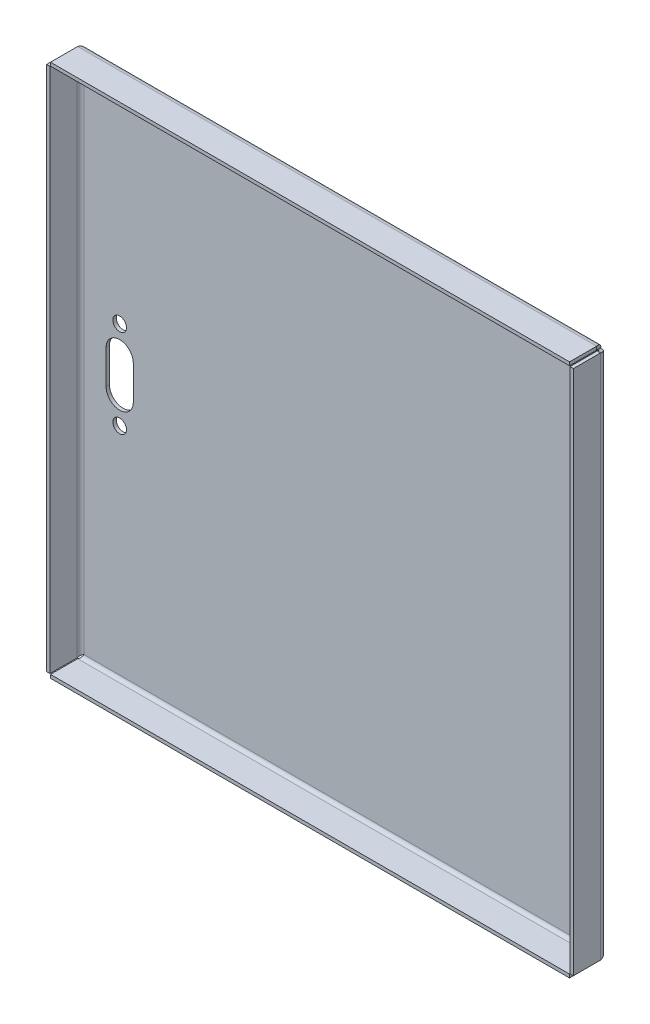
ISO-10303-21;
HEADER;
FILE_DESCRIPTION(('STEP AP214'),'2;1');
FILE_NAME('part.step','',(''),(''),'','','');
FILE_SCHEMA(('AUTOMOTIVE_DESIGN { 1 0 10303 214 1 1 1 1 }'));
ENDSEC;
DATA;
#1=APPLICATION_CONTEXT('core data for automotive mechanical design processes');
#2=APPLICATION_PROTOCOL_DEFINITION('international standard','automotive_design',2000,#1);
#3=PRODUCT_CONTEXT('',#1,'mechanical');
#4=PRODUCT('Part','Part','',(#3));
#5=PRODUCT_RELATED_PRODUCT_CATEGORY('part','',(#4));
#6=PRODUCT_DEFINITION_FORMATION('','',#4);
#7=PRODUCT_DEFINITION_CONTEXT('part definition',#1,'design');
#8=PRODUCT_DEFINITION('design','',#6,#7);
#9=PRODUCT_DEFINITION_SHAPE('','',#8);
#10=(LENGTH_UNIT() NAMED_UNIT(*) SI_UNIT(.MILLI.,.METRE.));
#11=(NAMED_UNIT(*) PLANE_ANGLE_UNIT() SI_UNIT($,.RADIAN.));
#12=(NAMED_UNIT(*) SI_UNIT($,.STERADIAN.) SOLID_ANGLE_UNIT());
#13=UNCERTAINTY_MEASURE_WITH_UNIT(LENGTH_MEASURE(1.E-05),#10,'distance_accuracy_value','');
#14=(GEOMETRIC_REPRESENTATION_CONTEXT(3) GLOBAL_UNCERTAINTY_ASSIGNED_CONTEXT((#13)) GLOBAL_UNIT_ASSIGNED_CONTEXT((#10,
#11,#12)) REPRESENTATION_CONTEXT('',''));
#15=CARTESIAN_POINT('',(0.,0.,0.));
#16=DIRECTION('',(0.,0.,1.));
#17=DIRECTION('',(1.,0.,0.));
#18=AXIS2_PLACEMENT_3D('',#15,#16,#17);
#19=CARTESIAN_POINT('',(0.,0.,-1.));
#20=DIRECTION('',(0.,0.,-1.));
#21=DIRECTION('',(-1.,0.,0.));
#22=AXIS2_PLACEMENT_3D('',#19,#20,#21);
#23=PLANE('',#22);
#24=CARTESIAN_POINT('',(-65.,-13.,-1.));
#25=DIRECTION('',(0.,0.,-1.));
#26=DIRECTION('',(1.,0.,0.));
#27=AXIS2_PLACEMENT_3D('',#24,#25,#26);
#28=CIRCLE('',#27,2.);
#29=CARTESIAN_POINT('',(-63.,-13.,-1.));
#30=VERTEX_POINT('',#29);
#31=EDGE_CURVE('E312',#30,#30,#28,.T.);
#32=ORIENTED_EDGE('',*,*,#31,.F.);
#33=EDGE_LOOP('',(#32));
#34=FACE_BOUND('',#33,.T.);
#35=CARTESIAN_POINT('',(-65.,13.,-1.));
#36=DIRECTION('',(0.,0.,-1.));
#37=DIRECTION('',(-1.,0.,0.));
#38=AXIS2_PLACEMENT_3D('',#35,#36,#37);
#39=CIRCLE('',#38,2.);
#40=CARTESIAN_POINT('',(-67.,13.,-1.));
#41=VERTEX_POINT('',#40);
#42=EDGE_CURVE('E683',#41,#41,#39,.T.);
#43=ORIENTED_EDGE('',*,*,#42,.F.);
#44=EDGE_LOOP('',(#43));
#45=FACE_BOUND('',#44,.T.);
#46=CARTESIAN_POINT('',(-65.,-5.00000000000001,-1.));
#47=DIRECTION('',(0.,0.,-1.));
#48=DIRECTION('',(-1.,0.,0.));
#49=AXIS2_PLACEMENT_3D('',#46,#47,#48);
#50=CIRCLE('',#49,4.00000000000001);
#51=CARTESIAN_POINT('',(-61.,-5.00000000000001,-1.));
#52=VERTEX_POINT('',#51);
#53=CARTESIAN_POINT('',(-69.,-5.,-1.));
#54=VERTEX_POINT('',#53);
#55=EDGE_CURVE('E143',#52,#54,#50,.T.);
#56=ORIENTED_EDGE('',*,*,#55,.F.);
#57=DIRECTION('',(0.,-1.,0.));
#58=VECTOR('',#57,1.);
#59=CARTESIAN_POINT('',(-61.,-5.00000000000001,-1.));
#60=LINE('',#59,#58);
#61=CARTESIAN_POINT('',(-61.,5.,-1.));
#62=VERTEX_POINT('',#61);
#63=EDGE_CURVE('E306',#62,#52,#60,.T.);
#64=ORIENTED_EDGE('',*,*,#63,.F.);
#65=CARTESIAN_POINT('',(-65.,5.,-1.));
#66=DIRECTION('',(0.,0.,-1.));
#67=DIRECTION('',(-1.,0.,0.));
#68=AXIS2_PLACEMENT_3D('',#65,#66,#67);
#69=CIRCLE('',#68,4.);
#70=CARTESIAN_POINT('',(-69.,5.,-1.));
#71=VERTEX_POINT('',#70);
#72=EDGE_CURVE('E309',#71,#62,#69,.T.);
#73=ORIENTED_EDGE('',*,*,#72,.F.);
#74=DIRECTION('',(0.,1.,0.));
#75=VECTOR('',#74,1.);
#76=CARTESIAN_POINT('',(-69.,-5.,-1.));
#77=LINE('',#76,#75);
#78=EDGE_CURVE('E318',#54,#71,#77,.T.);
#79=ORIENTED_EDGE('',*,*,#78,.F.);
#80=EDGE_LOOP('',(#56,#64,#73,#79));
#81=FACE_BOUND('',#80,.T.);
#82=DIRECTION('',(1.,0.,0.));
#83=VECTOR('',#82,1.);
#84=CARTESIAN_POINT('',(76.3585786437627,-76.5,-0.999999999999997));
#85=LINE('',#84,#83);
#86=CARTESIAN_POINT('',(75.5,-76.5,-0.999999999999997));
#87=VERTEX_POINT('',#86);
#88=CARTESIAN_POINT('',(-75.5,-76.5,-0.999999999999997));
#89=VERTEX_POINT('',#88);
#90=EDGE_CURVE('E472',#87,#89,#85,.F.);
#91=ORIENTED_EDGE('',*,*,#90,.T.);
#92=DIRECTION('',(0.,-1.,0.));
#93=VECTOR('',#92,1.);
#94=CARTESIAN_POINT('',(-75.5,-77.3585786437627,-0.999999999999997));
#95=LINE('',#94,#93);
#96=CARTESIAN_POINT('',(-75.5,76.5,-0.999999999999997));
#97=VERTEX_POINT('',#96);
#98=EDGE_CURVE('E361',#89,#97,#95,.F.);
#99=ORIENTED_EDGE('',*,*,#98,.T.);
#100=DIRECTION('',(-1.,0.,0.));
#101=VECTOR('',#100,1.);
#102=CARTESIAN_POINT('',(-76.3585786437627,76.5,-0.999999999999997));
#103=LINE('',#102,#101);
#104=CARTESIAN_POINT('',(75.5,76.5,-0.999999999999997));
#105=VERTEX_POINT('',#104);
#106=EDGE_CURVE('E539',#97,#105,#103,.F.);
#107=ORIENTED_EDGE('',*,*,#106,.T.);
#108=DIRECTION('',(0.,1.,0.));
#109=VECTOR('',#108,1.);
#110=CARTESIAN_POINT('',(75.5,77.3585786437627,-0.999999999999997));
#111=LINE('',#110,#109);
#112=EDGE_CURVE('E650',#105,#87,#111,.F.);
#113=ORIENTED_EDGE('',*,*,#112,.T.);
#114=EDGE_LOOP('',(#91,#99,#107,#113));
#115=FACE_BOUND('',#114,.T.);
#116=ADVANCED_FACE('F120',(#34,#45,#81,#115),#23,.T.);
#117=CARTESIAN_POINT('',(0.,0.,0.));
#118=DIRECTION('',(0.,0.,-1.));
#119=DIRECTION('',(-1.,0.,0.));
#120=AXIS2_PLACEMENT_3D('',#117,#118,#119);
#121=PLANE('',#120);
#122=CARTESIAN_POINT('',(-65.,-13.,0.));
#123=DIRECTION('',(0.,0.,-1.));
#124=DIRECTION('',(1.,0.,0.));
#125=AXIS2_PLACEMENT_3D('',#122,#123,#124);
#126=CIRCLE('',#125,2.);
#127=CARTESIAN_POINT('',(-63.,-13.,0.));
#128=VERTEX_POINT('',#127);
#129=EDGE_CURVE('E1213',#128,#128,#126,.T.);
#130=ORIENTED_EDGE('',*,*,#129,.T.);
#131=EDGE_LOOP('',(#130));
#132=FACE_BOUND('',#131,.T.);
#133=CARTESIAN_POINT('',(-65.,13.,0.));
#134=DIRECTION('',(0.,0.,-1.));
#135=DIRECTION('',(-1.,0.,0.));
#136=AXIS2_PLACEMENT_3D('',#133,#134,#135);
#137=CIRCLE('',#136,2.);
#138=CARTESIAN_POINT('',(-67.,13.,0.));
#139=VERTEX_POINT('',#138);
#140=EDGE_CURVE('E319',#139,#139,#137,.T.);
#141=ORIENTED_EDGE('',*,*,#140,.T.);
#142=EDGE_LOOP('',(#141));
#143=FACE_BOUND('',#142,.T.);
#144=DIRECTION('',(0.,-1.,0.));
#145=VECTOR('',#144,1.);
#146=CARTESIAN_POINT('',(-61.,-5.00000000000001,0.));
#147=LINE('',#146,#145);
#148=CARTESIAN_POINT('',(-61.,5.,0.));
#149=VERTEX_POINT('',#148);
#150=CARTESIAN_POINT('',(-61.,-5.00000000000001,0.));
#151=VERTEX_POINT('',#150);
#152=EDGE_CURVE('E297',#149,#151,#147,.T.);
#153=ORIENTED_EDGE('',*,*,#152,.T.);
#154=CARTESIAN_POINT('',(-65.,-5.00000000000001,0.));
#155=DIRECTION('',(0.,0.,-1.));
#156=DIRECTION('',(-1.,0.,0.));
#157=AXIS2_PLACEMENT_3D('',#154,#155,#156);
#158=CIRCLE('',#157,4.00000000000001);
#159=CARTESIAN_POINT('',(-69.,-5.,0.));
#160=VERTEX_POINT('',#159);
#161=EDGE_CURVE('E291',#151,#160,#158,.T.);
#162=ORIENTED_EDGE('',*,*,#161,.T.);
#163=DIRECTION('',(0.,1.,0.));
#164=VECTOR('',#163,1.);
#165=CARTESIAN_POINT('',(-69.,-5.,0.));
#166=LINE('',#165,#164);
#167=CARTESIAN_POINT('',(-69.,5.,0.));
#168=VERTEX_POINT('',#167);
#169=EDGE_CURVE('E300',#160,#168,#166,.T.);
#170=ORIENTED_EDGE('',*,*,#169,.T.);
#171=CARTESIAN_POINT('',(-65.,5.,0.));
#172=DIRECTION('',(0.,0.,-1.));
#173=DIRECTION('',(-1.,0.,0.));
#174=AXIS2_PLACEMENT_3D('',#171,#172,#173);
#175=CIRCLE('',#174,4.);
#176=EDGE_CURVE('E151',#168,#149,#175,.T.);
#177=ORIENTED_EDGE('',*,*,#176,.T.);
#178=EDGE_LOOP('',(#153,#162,#170,#177));
#179=FACE_BOUND('',#178,.T.);
#180=DIRECTION('',(0.,-1.,0.));
#181=VECTOR('',#180,1.);
#182=CARTESIAN_POINT('',(-75.5,-77.3585786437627,0.));
#183=LINE('',#182,#181);
#184=CARTESIAN_POINT('',(-75.5,-76.5,0.));
#185=VERTEX_POINT('',#184);
#186=CARTESIAN_POINT('',(-75.5,76.5,0.));
#187=VERTEX_POINT('',#186);
#188=EDGE_CURVE('E358',#185,#187,#183,.F.);
#189=ORIENTED_EDGE('',*,*,#188,.F.);
#190=DIRECTION('',(1.,0.,0.));
#191=VECTOR('',#190,1.);
#192=CARTESIAN_POINT('',(76.3585786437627,-76.5,0.));
#193=LINE('',#192,#191);
#194=CARTESIAN_POINT('',(75.5,-76.5,0.));
#195=VERTEX_POINT('',#194);
#196=EDGE_CURVE('E504',#195,#185,#193,.F.);
#197=ORIENTED_EDGE('',*,*,#196,.F.);
#198=DIRECTION('',(0.,1.,0.));
#199=VECTOR('',#198,1.);
#200=CARTESIAN_POINT('',(75.5,77.3585786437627,0.));
#201=LINE('',#200,#199);
#202=CARTESIAN_POINT('',(75.5,76.5,0.));
#203=VERTEX_POINT('',#202);
#204=EDGE_CURVE('E715',#203,#195,#201,.F.);
#205=ORIENTED_EDGE('',*,*,#204,.F.);
#206=DIRECTION('',(-1.,0.,0.));
#207=VECTOR('',#206,1.);
#208=CARTESIAN_POINT('',(-76.3585786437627,76.5,0.));
#209=LINE('',#208,#207);
#210=EDGE_CURVE('E536',#187,#203,#209,.F.);
#211=ORIENTED_EDGE('',*,*,#210,.F.);
#212=EDGE_LOOP('',(#189,#197,#205,#211));
#213=FACE_BOUND('',#212,.T.);
#214=ADVANCED_FACE('F122',(#132,#143,#179,#213),#121,.F.);
#215=CARTESIAN_POINT('',(75.5,-76.5,-1.01));
#216=CARTESIAN_POINT('',(75.7631525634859,-76.5715602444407,-1.01));
#217=CARTESIAN_POINT('',(76.0261132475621,-76.6430964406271,-0.957685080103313));
#218=CARTESIAN_POINT('',(76.5122741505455,-76.7861928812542,-0.756310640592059));
#219=CARTESIAN_POINT('',(76.7352389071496,-76.8577411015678,-0.607330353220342));
#220=CARTESIAN_POINT('',(77.1073303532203,-77.0008375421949,-0.23523890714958));
#221=CARTESIAN_POINT('',(77.2563106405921,-77.0723857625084,-0.0122741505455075));
#222=CARTESIAN_POINT('',(77.4576850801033,-77.2154822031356,0.473886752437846));
#223=CARTESIAN_POINT('',(77.51,-77.287018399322,0.736847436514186));
#224=CARTESIAN_POINT('',(77.51,-77.3585786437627,0.999999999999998));
#225=CARTESIAN_POINT('',(75.5,-76.5,-0.999999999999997));
#226=CARTESIAN_POINT('',(75.7618433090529,-76.5715602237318,-0.999999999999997));
#227=CARTESIAN_POINT('',(76.0234957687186,-76.6430964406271,-0.94794535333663));
#228=CARTESIAN_POINT('',(76.5072379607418,-76.7861928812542,-0.747572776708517));
#229=CARTESIAN_POINT('',(76.7290934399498,-76.8577411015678,-0.59933368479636));
#230=CARTESIAN_POINT('',(77.0993336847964,-77.0008375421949,-0.22909343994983));
#231=CARTESIAN_POINT('',(77.2475727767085,-77.0723857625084,-0.00723796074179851));
#232=CARTESIAN_POINT('',(77.4479453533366,-77.2154822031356,0.476504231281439));
#233=CARTESIAN_POINT('',(77.5,-77.2870184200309,0.738156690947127));
#234=CARTESIAN_POINT('',(77.5,-77.3585786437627,0.999999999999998));
#235=CARTESIAN_POINT('',(75.5,-76.5,0.));
#236=CARTESIAN_POINT('',(75.6309178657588,-76.5715581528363,0.));
#237=CARTESIAN_POINT('',(75.7617478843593,-76.6430964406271,0.0260273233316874));
#238=CARTESIAN_POINT('',(76.0036189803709,-76.7861928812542,0.126213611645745));
#239=CARTESIAN_POINT('',(76.1145467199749,-76.8577411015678,0.200333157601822));
#240=CARTESIAN_POINT('',(76.2996668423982,-77.0008375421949,0.385453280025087));
#241=CARTESIAN_POINT('',(76.3737863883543,-77.0723857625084,0.496381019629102));
#242=CARTESIAN_POINT('',(76.4739726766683,-77.2154822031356,0.738252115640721));
#243=CARTESIAN_POINT('',(76.5,-77.2870204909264,0.869082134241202));
#244=CARTESIAN_POINT('',(76.5,-77.3585786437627,1.));
#245=CARTESIAN_POINT('',(75.5,-76.5,0.010100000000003));
#246=CARTESIAN_POINT('',(75.6295955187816,-76.5715581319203,0.010100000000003));
#247=CARTESIAN_POINT('',(75.7591042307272,-76.6430964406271,0.0358644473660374));
#248=CARTESIAN_POINT('',(75.9985324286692,-76.7861928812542,0.135038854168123));
#249=CARTESIAN_POINT('',(76.1083397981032,-76.8577411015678,0.208409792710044));
#250=CARTESIAN_POINT('',(76.29159020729,-77.0008375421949,0.391660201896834));
#251=CARTESIAN_POINT('',(76.3649611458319,-77.0723857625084,0.501467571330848));
#252=CARTESIAN_POINT('',(76.464135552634,-77.2154822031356,0.74089576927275));
#253=CARTESIAN_POINT('',(76.4899,-77.2870205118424,0.870404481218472));
#254=CARTESIAN_POINT('',(76.4899,-77.3585786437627,1.));
#255=B_SPLINE_SURFACE_WITH_KNOTS('',1,3,((#215,#216,#217,#218,#219,#220,#221,#222,#223,#224),
(#225,#226,#227,#228,#229,#230,#231,#232,#233,#234),(#235,#236,#237,#238,#239,#240,#241,#242,
#243,#244),(#245,#246,#247,#248,#249,#250,#251,#252,#253,#254)),.UNSPECIFIED.,.F.,.F.,.F.,(2,1,
1,2),(4,2,2,2,4),(-0.01,0.,1.,1.0101),(0.,0.25,0.5,0.75,1.),.UNSPECIFIED.);
#256=DIRECTION('',(-1.,0.,0.));
#257=VECTOR('',#256,1.);
#258=CARTESIAN_POINT('',(76.5,-77.3585786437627,1.));
#259=LINE('',#258,#257);
#260=CARTESIAN_POINT('',(77.5,-77.3585786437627,0.999999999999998));
#261=VERTEX_POINT('',#260);
#262=CARTESIAN_POINT('',(76.5,-77.3585786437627,1.));
#263=VERTEX_POINT('',#262);
#264=EDGE_CURVE('E735',#261,#263,#259,.T.);
#265=CARTESIAN_POINT('',(75.5,-76.5,0.));
#266=CARTESIAN_POINT('',(75.5375759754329,-76.5205400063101,-9.14186350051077E-06));
#267=CARTESIAN_POINT('',(75.5751498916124,-76.5410779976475,0.00211767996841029));
#268=CARTESIAN_POINT('',(75.6498240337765,-76.5821539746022,0.0105759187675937));
#269=CARTESIAN_POINT('',(75.6869242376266,-76.6026919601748,0.0169075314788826));
#270=CARTESIAN_POINT('',(75.7600880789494,-76.6437197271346,0.0336874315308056));
#271=CARTESIAN_POINT('',(75.7961540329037,-76.6642095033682,0.0441255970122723));
#272=CARTESIAN_POINT('',(75.8668714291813,-76.7051801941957,0.068972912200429));
#273=CARTESIAN_POINT('',(75.9015231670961,-76.725661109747,0.0833812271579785));
#274=CARTESIAN_POINT('',(75.9930294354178,-76.7812189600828,0.127630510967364));
#275=CARTESIAN_POINT('',(76.0481421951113,-76.8163143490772,0.161158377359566));
#276=CARTESIAN_POINT('',(76.1508662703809,-76.886466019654,0.238098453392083));
#277=CARTESIAN_POINT('',(76.1984831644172,-76.9215223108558,0.281503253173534));
#278=CARTESIAN_POINT('',(76.2845367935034,-76.9916291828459,0.376613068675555));
#279=CARTESIAN_POINT('',(76.3229754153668,-77.026679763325,0.428316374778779));
#280=CARTESIAN_POINT('',(76.3892703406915,-77.0967969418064,0.53813900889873));
#281=CARTESIAN_POINT('',(76.4171220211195,-77.1318635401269,0.596261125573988));
#282=CARTESIAN_POINT('',(76.4592364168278,-77.198884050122,0.711415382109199));
#283=CARTESIAN_POINT('',(76.4744862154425,-77.2308378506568,0.768085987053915));
#284=CARTESIAN_POINT('',(76.4897734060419,-77.2787388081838,0.854380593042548));
#285=CARTESIAN_POINT('',(76.4936045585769,-77.2947040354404,0.88336618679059));
#286=CARTESIAN_POINT('',(76.4987183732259,-77.3266368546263,0.941564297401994));
#287=CARTESIAN_POINT('',(76.5000007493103,-77.3426044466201,0.970776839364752));
#288=CARTESIAN_POINT('',(76.5,-77.3585786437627,1.));
#289=B_SPLINE_CURVE_WITH_KNOTS('',3,(#265,#266,#267,#268,#269,#270,#271,#272,#273,#274,#275,
#276,#277,#278,#279,#280,#281,#282,#283,#284,#285,#286,#287,#288),.UNSPECIFIED.,.F.,.F.,(4,2,2,
2,2,2,2,2,2,2,2,4),(0.,0.128412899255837,0.25683177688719,0.384936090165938,0.513013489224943,
0.732204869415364,0.95123234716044,1.17021475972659,1.38929268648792,1.58891634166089,
1.68876822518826,1.78863131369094),.UNSPECIFIED.);
#290=EDGE_CURVE('E651',#195,#263,#289,.T.);
#291=DIRECTION('',(0.,0.,-1.));
#292=VECTOR('',#291,1.);
#293=CARTESIAN_POINT('',(75.5,-76.5,0.));
#294=LINE('',#293,#292);
#295=EDGE_CURVE('E13',#195,#87,#294,.T.);
#296=CARTESIAN_POINT('',(75.5,-76.5,-0.999999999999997));
#297=CARTESIAN_POINT('',(75.5583401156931,-76.5159452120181,-0.99999996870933));
#298=CARTESIAN_POINT('',(75.6166524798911,-76.5318819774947,-0.997445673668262));
#299=CARTESIAN_POINT('',(75.7328288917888,-76.5637539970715,-0.987257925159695));
#300=CARTESIAN_POINT('',(75.7906929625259,-76.5796892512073,-0.979624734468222));
#301=CARTESIAN_POINT('',(75.9628402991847,-76.6274649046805,-0.949184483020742));
#302=CARTESIAN_POINT('',(76.0758766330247,-76.6593284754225,-0.918836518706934));
#303=CARTESIAN_POINT('',(76.2949589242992,-76.723062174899,-0.838930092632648));
#304=CARTESIAN_POINT('',(76.4010003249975,-76.7549322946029,-0.789359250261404));
#305=CARTESIAN_POINT('',(76.6028313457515,-76.8186657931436,-0.67252732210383));
#306=CARTESIAN_POINT('',(76.6986232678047,-76.8505291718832,-0.605270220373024));
#307=CARTESIAN_POINT('',(76.8770334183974,-76.9142577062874,-0.455120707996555));
#308=CARTESIAN_POINT('',(76.9596522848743,-76.9461228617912,-0.372229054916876));
#309=CARTESIAN_POINT('',(77.1092334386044,-77.009860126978,-0.19330021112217));
#310=CARTESIAN_POINT('',(77.1761906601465,-77.0417322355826,-0.0972587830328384));
#311=CARTESIAN_POINT('',(77.292385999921,-77.105487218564,0.10502989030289));
#312=CARTESIAN_POINT('',(77.3416179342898,-77.1373700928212,0.211280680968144));
#313=CARTESIAN_POINT('',(77.4207925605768,-77.201117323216,0.430681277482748));
#314=CARTESIAN_POINT('',(77.450754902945,-77.2329816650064,0.543823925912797));
#315=CARTESIAN_POINT('',(77.4804210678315,-77.2804603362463,0.715003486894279));
#316=CARTESIAN_POINT('',(77.4877639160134,-77.2960984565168,0.771805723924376));
#317=CARTESIAN_POINT('',(77.4975489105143,-77.3273478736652,0.885730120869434));
#318=CARTESIAN_POINT('',(77.4999996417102,-77.3429591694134,0.942851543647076));
#319=CARTESIAN_POINT('',(77.5,-77.3585786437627,0.999999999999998));
#320=B_SPLINE_CURVE_WITH_KNOTS('',3,(#296,#297,#298,#299,#300,#301,#302,#303,#304,#305,#306,
#307,#308,#309,#310,#311,#312,#313,#314,#315,#316,#317,#318,#319),.UNSPECIFIED.,.F.,.F.,(4,2,2,
2,2,2,2,2,2,2,2,4),(0.,0.181328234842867,0.362647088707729,0.724677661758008,1.08694179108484,
1.44912438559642,1.81128943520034,2.17357146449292,2.5359797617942,2.89801789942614,
3.07595727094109,3.25358411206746),.UNSPECIFIED.);
#321=EDGE_CURVE('E637',#87,#261,#320,.T.);
#322=ORIENTED_EDGE('',*,*,#264,.T.);
#323=ORIENTED_EDGE('',*,*,#290,.F.);
#324=ORIENTED_EDGE('',*,*,#295,.T.);
#325=ORIENTED_EDGE('',*,*,#321,.T.);
#326=EDGE_LOOP('',(#322,#323,#324,#325));
#327=FACE_BOUND('',#326,.T.);
#328=ADVANCED_FACE('F660',(#327),#255,.F.);
#329=CARTESIAN_POINT('',(77.51,77.3585786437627,0.999999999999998));
#330=CARTESIAN_POINT('',(77.51,77.287018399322,0.736847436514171));
#331=CARTESIAN_POINT('',(77.4576850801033,77.2154822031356,0.473886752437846));
#332=CARTESIAN_POINT('',(77.2563106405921,77.0723857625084,-0.0122741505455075));
#333=CARTESIAN_POINT('',(77.1073303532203,77.0008375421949,-0.23523890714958));
#334=CARTESIAN_POINT('',(76.7352389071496,76.8577411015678,-0.607330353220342));
#335=CARTESIAN_POINT('',(76.5122741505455,76.7861928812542,-0.756310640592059));
#336=CARTESIAN_POINT('',(76.0261132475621,76.6430964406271,-0.957685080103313));
#337=CARTESIAN_POINT('',(75.7631525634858,76.5715602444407,-1.01));
#338=CARTESIAN_POINT('',(75.5,76.5,-1.01));
#339=CARTESIAN_POINT('',(77.5,77.3585786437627,0.999999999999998));
#340=CARTESIAN_POINT('',(77.5,77.2870184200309,0.738156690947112));
#341=CARTESIAN_POINT('',(77.4479453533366,77.2154822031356,0.476504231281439));
#342=CARTESIAN_POINT('',(77.2475727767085,77.0723857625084,-0.00723796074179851));
#343=CARTESIAN_POINT('',(77.0993336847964,77.0008375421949,-0.22909343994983));
#344=CARTESIAN_POINT('',(76.7290934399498,76.8577411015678,-0.59933368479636));
#345=CARTESIAN_POINT('',(76.5072379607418,76.7861928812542,-0.747572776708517));
#346=CARTESIAN_POINT('',(76.0234957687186,76.6430964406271,-0.94794535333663));
#347=CARTESIAN_POINT('',(75.7618433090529,76.5715602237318,-0.999999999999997));
#348=CARTESIAN_POINT('',(75.5,76.5,-0.999999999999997));
#349=CARTESIAN_POINT('',(76.5,77.3585786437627,1.));
#350=CARTESIAN_POINT('',(76.5,77.2870204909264,0.869082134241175));
#351=CARTESIAN_POINT('',(76.4739726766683,77.2154822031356,0.738252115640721));
#352=CARTESIAN_POINT('',(76.3737863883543,77.0723857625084,0.496381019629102));
#353=CARTESIAN_POINT('',(76.2996668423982,77.0008375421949,0.385453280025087));
#354=CARTESIAN_POINT('',(76.1145467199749,76.8577411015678,0.200333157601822));
#355=CARTESIAN_POINT('',(76.0036189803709,76.7861928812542,0.126213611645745));
#356=CARTESIAN_POINT('',(75.7617478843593,76.6430964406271,0.0260273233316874));
#357=CARTESIAN_POINT('',(75.6309178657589,76.5715581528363,0.));
#358=CARTESIAN_POINT('',(75.5,76.5,0.));
#359=CARTESIAN_POINT('',(76.4899,77.3585786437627,1.));
#360=CARTESIAN_POINT('',(76.4899,77.2870205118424,0.870404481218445));
#361=CARTESIAN_POINT('',(76.464135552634,77.2154822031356,0.74089576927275));
#362=CARTESIAN_POINT('',(76.3649611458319,77.0723857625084,0.501467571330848));
#363=CARTESIAN_POINT('',(76.29159020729,77.0008375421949,0.391660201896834));
#364=CARTESIAN_POINT('',(76.1083397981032,76.8577411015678,0.208409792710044));
#365=CARTESIAN_POINT('',(75.9985324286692,76.7861928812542,0.135038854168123));
#366=CARTESIAN_POINT('',(75.7591042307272,76.6430964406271,0.0358644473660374));
#367=CARTESIAN_POINT('',(75.6295955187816,76.5715581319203,0.010100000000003));
#368=CARTESIAN_POINT('',(75.5,76.5,0.010100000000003));
#369=B_SPLINE_SURFACE_WITH_KNOTS('',1,3,((#329,#330,#331,#332,#333,#334,#335,#336,#337,#338),
(#339,#340,#341,#342,#343,#344,#345,#346,#347,#348),(#349,#350,#351,#352,#353,#354,#355,#356,
#357,#358),(#359,#360,#361,#362,#363,#364,#365,#366,#367,#368)),.UNSPECIFIED.,.F.,.F.,.F.,(2,1,
1,2),(4,2,2,2,4),(-0.01,0.,1.,1.0101),(0.,0.25,0.5,0.75,1.),.UNSPECIFIED.);
#370=CARTESIAN_POINT('',(76.5,77.3585786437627,1.));
#371=CARTESIAN_POINT('',(76.5000091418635,77.3380386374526,0.96242402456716));
#372=CARTESIAN_POINT('',(76.4978823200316,77.3175006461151,0.924850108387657));
#373=CARTESIAN_POINT('',(76.4894240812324,77.2764246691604,0.850175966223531));
#374=CARTESIAN_POINT('',(76.4830924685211,77.2558866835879,0.813075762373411));
#375=CARTESIAN_POINT('',(76.4663125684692,77.2148589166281,0.739911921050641));
#376=CARTESIAN_POINT('',(76.4558744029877,77.1943691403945,0.703845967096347));
#377=CARTESIAN_POINT('',(76.4310270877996,77.153398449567,0.633128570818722));
#378=CARTESIAN_POINT('',(76.416618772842,77.1329175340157,0.598476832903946));
#379=CARTESIAN_POINT('',(76.3723694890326,77.0773596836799,0.506970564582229));
#380=CARTESIAN_POINT('',(76.3388416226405,77.0422642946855,0.451857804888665));
#381=CARTESIAN_POINT('',(76.2619015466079,76.9721126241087,0.349133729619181));
#382=CARTESIAN_POINT('',(76.2184967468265,76.9370563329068,0.301516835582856));
#383=CARTESIAN_POINT('',(76.1233869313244,76.8669494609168,0.215463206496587));
#384=CARTESIAN_POINT('',(76.0716836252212,76.8318988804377,0.177024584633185));
#385=CARTESIAN_POINT('',(75.9618609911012,76.7617817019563,0.110729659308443));
#386=CARTESIAN_POINT('',(75.903738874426,76.7267151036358,0.0828779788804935));
#387=CARTESIAN_POINT('',(75.7885846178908,76.6596945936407,0.0407635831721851));
#388=CARTESIAN_POINT('',(75.7319140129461,76.6277407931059,0.02551378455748));
#389=CARTESIAN_POINT('',(75.6456194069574,76.5798398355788,0.0102265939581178));
#390=CARTESIAN_POINT('',(75.6166338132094,76.5638746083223,0.00639544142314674));
#391=CARTESIAN_POINT('',(75.558435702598,76.5319417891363,0.00128162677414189));
#392=CARTESIAN_POINT('',(75.5292231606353,76.5159741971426,-7.49310340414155E-07));
#393=CARTESIAN_POINT('',(75.5,76.5,0.));
#394=B_SPLINE_CURVE_WITH_KNOTS('',3,(#370,#371,#372,#373,#374,#375,#376,#377,#378,#379,#380,
#381,#382,#383,#384,#385,#386,#387,#388,#389,#390,#391,#392,#393),.UNSPECIFIED.,.F.,.F.,(4,2,2,
2,2,2,2,2,2,2,2,4),(0.,0.128412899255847,0.256831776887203,0.384936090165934,0.513013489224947,
0.732204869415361,0.951232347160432,1.17021475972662,1.38929268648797,1.58891634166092,
1.68876822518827,1.78863131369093),.UNSPECIFIED.);
#395=CARTESIAN_POINT('',(76.5,77.3585786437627,1.));
#396=VERTEX_POINT('',#395);
#397=EDGE_CURVE('E124',#396,#203,#394,.T.);
#398=DIRECTION('',(1.,0.,0.));
#399=VECTOR('',#398,1.);
#400=CARTESIAN_POINT('',(76.5,77.3585786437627,1.));
#401=LINE('',#400,#399);
#402=CARTESIAN_POINT('',(77.5,77.3585786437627,0.999999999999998));
#403=VERTEX_POINT('',#402);
#404=EDGE_CURVE('E593',#403,#396,#401,.F.);
#405=CARTESIAN_POINT('',(77.5,77.3585786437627,0.999999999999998));
#406=CARTESIAN_POINT('',(77.4999999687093,77.3426334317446,0.941659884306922));
#407=CARTESIAN_POINT('',(77.4974456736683,77.326696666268,0.883347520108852));
#408=CARTESIAN_POINT('',(77.4872579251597,77.2948246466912,0.767171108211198));
#409=CARTESIAN_POINT('',(77.4796247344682,77.2788893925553,0.709307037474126));
#410=CARTESIAN_POINT('',(77.4491844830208,77.2311137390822,0.5371597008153));
#411=CARTESIAN_POINT('',(77.4188365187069,77.1992501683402,0.42412336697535));
#412=CARTESIAN_POINT('',(77.3389300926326,77.1355164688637,0.20504107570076));
#413=CARTESIAN_POINT('',(77.2893592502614,77.1036463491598,0.0989996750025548));
#414=CARTESIAN_POINT('',(77.1725273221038,77.039912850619,-0.102831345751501));
#415=CARTESIAN_POINT('',(77.105270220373,77.0080494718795,-0.198623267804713));
#416=CARTESIAN_POINT('',(76.9551207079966,76.9443209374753,-0.377033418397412));
#417=CARTESIAN_POINT('',(76.8722290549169,76.9124557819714,-0.459652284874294));
#418=CARTESIAN_POINT('',(76.6933002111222,76.8487185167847,-0.609233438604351));
#419=CARTESIAN_POINT('',(76.5972587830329,76.8168464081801,-0.676190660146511));
#420=CARTESIAN_POINT('',(76.3949701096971,76.7530914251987,-0.792385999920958));
#421=CARTESIAN_POINT('',(76.2887193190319,76.7212085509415,-0.841617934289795));
#422=CARTESIAN_POINT('',(76.0693187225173,76.6574613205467,-0.920792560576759));
#423=CARTESIAN_POINT('',(75.9561760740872,76.6255969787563,-0.950754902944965));
#424=CARTESIAN_POINT('',(75.7849965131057,76.5781183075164,-0.980421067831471));
#425=CARTESIAN_POINT('',(75.7281942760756,76.5624801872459,-0.987763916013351));
#426=CARTESIAN_POINT('',(75.6142698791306,76.5312307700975,-0.997548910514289));
#427=CARTESIAN_POINT('',(75.5571484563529,76.5156194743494,-0.999999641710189));
#428=CARTESIAN_POINT('',(75.5,76.5,-0.999999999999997));
#429=B_SPLINE_CURVE_WITH_KNOTS('',3,(#405,#406,#407,#408,#409,#410,#411,#412,#413,#414,#415,
#416,#417,#418,#419,#420,#421,#422,#423,#424,#425,#426,#427,#428),.UNSPECIFIED.,.F.,.F.,(4,2,2,
2,2,2,2,2,2,2,2,4),(0.,0.181328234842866,0.362647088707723,0.724677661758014,1.08694179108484,
1.4491243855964,1.81128943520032,2.17357146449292,2.5359797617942,2.89801789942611,
3.07595727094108,3.25358411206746),.UNSPECIFIED.);
#430=EDGE_CURVE('E644',#403,#105,#429,.T.);
#431=DIRECTION('',(0.,0.,-1.));
#432=VECTOR('',#431,1.);
#433=CARTESIAN_POINT('',(75.5,76.5,0.));
#434=LINE('',#433,#432);
#435=EDGE_CURVE('E135',#203,#105,#434,.T.);
#436=ORIENTED_EDGE('',*,*,#397,.F.);
#437=ORIENTED_EDGE('',*,*,#404,.F.);
#438=ORIENTED_EDGE('',*,*,#430,.T.);
#439=ORIENTED_EDGE('',*,*,#435,.F.);
#440=EDGE_LOOP('',(#436,#437,#438,#439));
#441=FACE_BOUND('',#440,.T.);
#442=ADVANCED_FACE('F631',(#441),#369,.F.);
#443=CARTESIAN_POINT('',(75.5,77.3585786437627,1.));
#444=DIRECTION('',(0.,1.,0.));
#445=DIRECTION('',(1.,0.,0.));
#446=AXIS2_PLACEMENT_3D('',#443,#444,#445);
#447=CYLINDRICAL_SURFACE('',#446,2.);
#448=ORIENTED_EDGE('',*,*,#112,.F.);
#449=ORIENTED_EDGE('',*,*,#430,.F.);
#450=DIRECTION('',(0.,1.,0.));
#451=VECTOR('',#450,1.);
#452=CARTESIAN_POINT('',(77.5,-78.5,0.999999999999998));
#453=LINE('',#452,#451);
#454=EDGE_CURVE('E746',#403,#261,#453,.F.);
#455=ORIENTED_EDGE('',*,*,#454,.T.);
#456=ORIENTED_EDGE('',*,*,#321,.F.);
#457=EDGE_LOOP('',(#448,#449,#455,#456));
#458=FACE_BOUND('',#457,.T.);
#459=ADVANCED_FACE('F628',(#458),#447,.T.);
#460=CARTESIAN_POINT('',(75.5,77.3585786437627,1.));
#461=DIRECTION('',(0.,1.,0.));
#462=DIRECTION('',(1.,0.,0.));
#463=AXIS2_PLACEMENT_3D('',#460,#461,#462);
#464=CYLINDRICAL_SURFACE('',#463,1.);
#465=ORIENTED_EDGE('',*,*,#204,.T.);
#466=ORIENTED_EDGE('',*,*,#290,.T.);
#467=DIRECTION('',(0.,1.,0.));
#468=VECTOR('',#467,1.);
#469=CARTESIAN_POINT('',(76.5,-78.5,1.));
#470=LINE('',#469,#468);
#471=EDGE_CURVE('E732',#263,#396,#470,.T.);
#472=ORIENTED_EDGE('',*,*,#471,.T.);
#473=ORIENTED_EDGE('',*,*,#397,.T.);
#474=EDGE_LOOP('',(#465,#466,#472,#473));
#475=FACE_BOUND('',#474,.T.);
#476=ADVANCED_FACE('F616',(#475),#464,.F.);
#477=CARTESIAN_POINT('',(76.5,-77.3585786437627,0.));
#478=DIRECTION('',(0.,-1.,0.));
#479=DIRECTION('',(0.,0.,-1.));
#480=AXIS2_PLACEMENT_3D('',#477,#478,#479);
#481=PLANE('',#480);
#482=DIRECTION('',(0.,0.,-1.));
#483=VECTOR('',#482,1.);
#484=CARTESIAN_POINT('',(77.5,-77.3585786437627,0.));
#485=LINE('',#484,#483);
#486=CARTESIAN_POINT('',(77.5,-77.3585786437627,9.));
#487=VERTEX_POINT('',#486);
#488=EDGE_CURVE('E752',#261,#487,#485,.F.);
#489=ORIENTED_EDGE('',*,*,#488,.T.);
#490=DIRECTION('',(1.,0.,0.));
#491=VECTOR('',#490,1.);
#492=CARTESIAN_POINT('',(76.5,-77.3585786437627,9.00000000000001));
#493=LINE('',#492,#491);
#494=CARTESIAN_POINT('',(76.5,-77.3585786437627,9.00000000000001));
#495=VERTEX_POINT('',#494);
#496=EDGE_CURVE('E749',#487,#495,#493,.F.);
#497=ORIENTED_EDGE('',*,*,#496,.T.);
#498=DIRECTION('',(0.,0.,1.));
#499=VECTOR('',#498,1.);
#500=CARTESIAN_POINT('',(76.5,-77.3585786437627,-2.39006345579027E-13));
#501=LINE('',#500,#499);
#502=EDGE_CURVE('E755',#263,#495,#501,.T.);
#503=ORIENTED_EDGE('',*,*,#502,.F.);
#504=ORIENTED_EDGE('',*,*,#264,.F.);
#505=EDGE_LOOP('',(#489,#497,#503,#504));
#506=FACE_BOUND('',#505,.T.);
#507=ADVANCED_FACE('F612',(#506),#481,.T.);
#508=CARTESIAN_POINT('',(77.5,0.,-2.4249782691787E-13));
#509=DIRECTION('',(-1.,0.,0.));
#510=DIRECTION('',(0.,0.,1.));
#511=AXIS2_PLACEMENT_3D('',#508,#509,#510);
#512=PLANE('',#511);
#513=ORIENTED_EDGE('',*,*,#454,.F.);
#514=DIRECTION('',(0.,0.,1.));
#515=VECTOR('',#514,1.);
#516=CARTESIAN_POINT('',(77.5,77.3585786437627,-2.4249782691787E-13));
#517=LINE('',#516,#515);
#518=CARTESIAN_POINT('',(77.5,77.3585786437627,9.));
#519=VERTEX_POINT('',#518);
#520=EDGE_CURVE('E760',#403,#519,#517,.T.);
#521=ORIENTED_EDGE('',*,*,#520,.T.);
#522=DIRECTION('',(0.,-1.,0.));
#523=VECTOR('',#522,1.);
#524=CARTESIAN_POINT('',(77.5,0.,9.));
#525=LINE('',#524,#523);
#526=EDGE_CURVE('E738',#519,#487,#525,.T.);
#527=ORIENTED_EDGE('',*,*,#526,.T.);
#528=ORIENTED_EDGE('',*,*,#488,.F.);
#529=EDGE_LOOP('',(#513,#521,#527,#528));
#530=FACE_BOUND('',#529,.T.);
#531=ADVANCED_FACE('F615',(#530),#512,.F.);
#532=CARTESIAN_POINT('',(76.5,0.,-2.39006345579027E-13));
#533=DIRECTION('',(-1.,0.,0.));
#534=DIRECTION('',(0.,0.,1.));
#535=AXIS2_PLACEMENT_3D('',#532,#533,#534);
#536=PLANE('',#535);
#537=DIRECTION('',(0.,0.,-1.));
#538=VECTOR('',#537,1.);
#539=CARTESIAN_POINT('',(76.5,77.3585786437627,0.));
#540=LINE('',#539,#538);
#541=CARTESIAN_POINT('',(76.5,77.3585786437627,9.00000000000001));
#542=VERTEX_POINT('',#541);
#543=EDGE_CURVE('E547',#396,#542,#540,.F.);
#544=ORIENTED_EDGE('',*,*,#543,.F.);
#545=ORIENTED_EDGE('',*,*,#471,.F.);
#546=ORIENTED_EDGE('',*,*,#502,.T.);
#547=DIRECTION('',(0.,1.,0.));
#548=VECTOR('',#547,1.);
#549=CARTESIAN_POINT('',(76.5,-78.5,9.00000000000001));
#550=LINE('',#549,#548);
#551=EDGE_CURVE('E742',#542,#495,#550,.F.);
#552=ORIENTED_EDGE('',*,*,#551,.F.);
#553=EDGE_LOOP('',(#544,#545,#546,#552));
#554=FACE_BOUND('',#553,.T.);
#555=ADVANCED_FACE('F620',(#554),#536,.T.);
#556=CARTESIAN_POINT('',(77.5,-78.5,9.));
#557=DIRECTION('',(0.,0.,-1.));
#558=DIRECTION('',(-1.,0.,0.));
#559=AXIS2_PLACEMENT_3D('',#556,#557,#558);
#560=PLANE('',#559);
#561=ORIENTED_EDGE('',*,*,#526,.F.);
#562=DIRECTION('',(-1.,0.,0.));
#563=VECTOR('',#562,1.);
#564=CARTESIAN_POINT('',(77.5,77.3585786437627,9.));
#565=LINE('',#564,#563);
#566=EDGE_CURVE('E758',#519,#542,#565,.T.);
#567=ORIENTED_EDGE('',*,*,#566,.T.);
#568=ORIENTED_EDGE('',*,*,#551,.T.);
#569=ORIENTED_EDGE('',*,*,#496,.F.);
#570=EDGE_LOOP('',(#561,#567,#568,#569));
#571=FACE_BOUND('',#570,.T.);
#572=ADVANCED_FACE('F610',(#571),#560,.F.);
#573=CARTESIAN_POINT('',(76.5,77.3585786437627,0.));
#574=DIRECTION('',(0.,-1.,0.));
#575=DIRECTION('',(0.,0.,-1.));
#576=AXIS2_PLACEMENT_3D('',#573,#574,#575);
#577=PLANE('',#576);
#578=ORIENTED_EDGE('',*,*,#566,.F.);
#579=ORIENTED_EDGE('',*,*,#520,.F.);
#580=ORIENTED_EDGE('',*,*,#404,.T.);
#581=ORIENTED_EDGE('',*,*,#543,.T.);
#582=EDGE_LOOP('',(#578,#579,#580,#581));
#583=FACE_BOUND('',#582,.T.);
#584=ADVANCED_FACE('F601',(#583),#577,.F.);
#585=CARTESIAN_POINT('',(75.5,76.5,-1.01));
#586=CARTESIAN_POINT('',(75.5715602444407,76.7631525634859,-1.01));
#587=CARTESIAN_POINT('',(75.6430964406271,77.0261132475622,-0.957685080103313));
#588=CARTESIAN_POINT('',(75.7861928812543,77.5122741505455,-0.756310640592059));
#589=CARTESIAN_POINT('',(75.8577411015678,77.7352389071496,-0.607330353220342));
#590=CARTESIAN_POINT('',(76.0008375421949,78.1073303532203,-0.23523890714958));
#591=CARTESIAN_POINT('',(76.0723857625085,78.2563106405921,-0.0122741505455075));
#592=CARTESIAN_POINT('',(76.2154822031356,78.4576850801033,0.473886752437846));
#593=CARTESIAN_POINT('',(76.287018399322,78.51,0.736847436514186));
#594=CARTESIAN_POINT('',(76.3585786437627,78.51,0.999999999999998));
#595=CARTESIAN_POINT('',(75.5,76.5,-0.999999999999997));
#596=CARTESIAN_POINT('',(75.5715602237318,76.7618433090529,-0.999999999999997));
#597=CARTESIAN_POINT('',(75.6430964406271,77.0234957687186,-0.94794535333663));
#598=CARTESIAN_POINT('',(75.7861928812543,77.5072379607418,-0.747572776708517));
#599=CARTESIAN_POINT('',(75.8577411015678,77.7290934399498,-0.59933368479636));
#600=CARTESIAN_POINT('',(76.0008375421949,78.0993336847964,-0.22909343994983));
#601=CARTESIAN_POINT('',(76.0723857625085,78.2475727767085,-0.00723796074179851));
#602=CARTESIAN_POINT('',(76.2154822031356,78.4479453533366,0.476504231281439));
#603=CARTESIAN_POINT('',(76.2870184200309,78.5,0.738156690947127));
#604=CARTESIAN_POINT('',(76.3585786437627,78.5,0.999999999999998));
#605=CARTESIAN_POINT('',(75.5,76.5,0.));
#606=CARTESIAN_POINT('',(75.5715581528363,76.6309178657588,0.));
#607=CARTESIAN_POINT('',(75.6430964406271,76.7617478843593,0.0260273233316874));
#608=CARTESIAN_POINT('',(75.7861928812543,77.0036189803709,0.126213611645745));
#609=CARTESIAN_POINT('',(75.8577411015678,77.1145467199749,0.200333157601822));
#610=CARTESIAN_POINT('',(76.0008375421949,77.2996668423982,0.385453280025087));
#611=CARTESIAN_POINT('',(76.0723857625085,77.3737863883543,0.496381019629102));
#612=CARTESIAN_POINT('',(76.2154822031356,77.4739726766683,0.738252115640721));
#613=CARTESIAN_POINT('',(76.2870204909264,77.5,0.869082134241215));
#614=CARTESIAN_POINT('',(76.3585786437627,77.5,1.));
#615=CARTESIAN_POINT('',(75.5,76.5,0.010100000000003));
#616=CARTESIAN_POINT('',(75.5715581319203,76.6295955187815,0.010100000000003));
#617=CARTESIAN_POINT('',(75.6430964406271,76.7591042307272,0.0358644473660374));
#618=CARTESIAN_POINT('',(75.7861928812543,76.9985324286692,0.135038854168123));
#619=CARTESIAN_POINT('',(75.8577411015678,77.1083397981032,0.208409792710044));
#620=CARTESIAN_POINT('',(76.0008375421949,77.29159020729,0.391660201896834));
#621=CARTESIAN_POINT('',(76.0723857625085,77.3649611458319,0.501467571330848));
#622=CARTESIAN_POINT('',(76.2154822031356,77.464135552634,0.74089576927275));
#623=CARTESIAN_POINT('',(76.2870205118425,77.4899,0.870404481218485));
#624=CARTESIAN_POINT('',(76.3585786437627,77.4899,1.));
#625=B_SPLINE_SURFACE_WITH_KNOTS('',1,3,((#585,#586,#587,#588,#589,#590,#591,#592,#593,#594),
(#595,#596,#597,#598,#599,#600,#601,#602,#603,#604),(#605,#606,#607,#608,#609,#610,#611,#612,
#613,#614),(#615,#616,#617,#618,#619,#620,#621,#622,#623,#624)),.UNSPECIFIED.,.F.,.F.,.F.,(2,1,
1,2),(4,2,2,2,4),(-0.01,0.,1.,1.0101),(0.,0.25,0.5,0.75,1.),.UNSPECIFIED.);
#626=DIRECTION('',(0.,-1.,0.));
#627=VECTOR('',#626,1.);
#628=CARTESIAN_POINT('',(76.3585786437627,77.5,1.));
#629=LINE('',#628,#627);
#630=CARTESIAN_POINT('',(76.3585786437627,78.5,0.999999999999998));
#631=VERTEX_POINT('',#630);
#632=CARTESIAN_POINT('',(76.3585786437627,77.5,1.));
#633=VERTEX_POINT('',#632);
#634=EDGE_CURVE('E509',#631,#633,#629,.T.);
#635=CARTESIAN_POINT('',(75.5,76.5,0.));
#636=CARTESIAN_POINT('',(75.5205400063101,76.5375759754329,-9.14186349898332E-06));
#637=CARTESIAN_POINT('',(75.5410779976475,76.5751498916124,0.00211767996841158));
#638=CARTESIAN_POINT('',(75.5821539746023,76.6498240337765,0.0105759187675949));
#639=CARTESIAN_POINT('',(75.6026919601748,76.6869242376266,0.0169075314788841));
#640=CARTESIAN_POINT('',(75.6437197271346,76.7600880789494,0.0336874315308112));
#641=CARTESIAN_POINT('',(75.6642095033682,76.7961540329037,0.0441255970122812));
#642=CARTESIAN_POINT('',(75.7051801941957,76.8668714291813,0.0689729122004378));
#643=CARTESIAN_POINT('',(75.7256611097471,76.9015231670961,0.0833812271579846));
#644=CARTESIAN_POINT('',(75.7812189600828,76.9930294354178,0.127630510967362));
#645=CARTESIAN_POINT('',(75.8163143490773,77.0481421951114,0.16115837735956));
#646=CARTESIAN_POINT('',(75.886466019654,77.1508662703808,0.238098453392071));
#647=CARTESIAN_POINT('',(75.9215223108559,77.1984831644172,0.281503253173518));
#648=CARTESIAN_POINT('',(75.9916291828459,77.2845367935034,0.376613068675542));
#649=CARTESIAN_POINT('',(76.026679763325,77.3229754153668,0.428316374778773));
#650=CARTESIAN_POINT('',(76.0967969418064,77.3892703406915,0.538139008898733));
#651=CARTESIAN_POINT('',(76.131863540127,77.4171220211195,0.596261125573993));
#652=CARTESIAN_POINT('',(76.1988840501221,77.4592364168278,0.711415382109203));
#653=CARTESIAN_POINT('',(76.2308378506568,77.4744862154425,0.768085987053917));
#654=CARTESIAN_POINT('',(76.2787388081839,77.4897734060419,0.854380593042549));
#655=CARTESIAN_POINT('',(76.2947040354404,77.4936045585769,0.883366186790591));
#656=CARTESIAN_POINT('',(76.3266368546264,77.4987183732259,0.941564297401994));
#657=CARTESIAN_POINT('',(76.3426044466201,77.5000007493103,0.970776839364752));
#658=CARTESIAN_POINT('',(76.3585786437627,77.5,1.));
#659=B_SPLINE_CURVE_WITH_KNOTS('',3,(#635,#636,#637,#638,#639,#640,#641,#642,#643,#644,#645,
#646,#647,#648,#649,#650,#651,#652,#653,#654,#655,#656,#657,#658),.UNSPECIFIED.,.F.,.F.,(4,2,2,
2,2,2,2,2,2,2,2,4),(0.,0.128412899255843,0.256831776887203,0.384936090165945,0.513013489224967,
0.732204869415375,0.951232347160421,1.17021475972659,1.38929268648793,1.58891634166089,
1.68876822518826,1.78863131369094),.UNSPECIFIED.);
#660=EDGE_CURVE('E538',#203,#633,#659,.T.);
#661=CARTESIAN_POINT('',(75.5,76.5,-0.999999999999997));
#662=CARTESIAN_POINT('',(75.5159452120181,76.5583401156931,-0.99999996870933));
#663=CARTESIAN_POINT('',(75.5318819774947,76.6166524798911,-0.997445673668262));
#664=CARTESIAN_POINT('',(75.5637539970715,76.7328288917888,-0.987257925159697));
#665=CARTESIAN_POINT('',(75.5796892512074,76.7906929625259,-0.979624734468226));
#666=CARTESIAN_POINT('',(75.6274649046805,76.9628402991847,-0.949184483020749));
#667=CARTESIAN_POINT('',(75.6593284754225,77.0758766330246,-0.918836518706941));
#668=CARTESIAN_POINT('',(75.723062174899,77.2949589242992,-0.838930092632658));
#669=CARTESIAN_POINT('',(75.7549322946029,77.4010003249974,-0.789359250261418));
#670=CARTESIAN_POINT('',(75.8186657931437,77.6028313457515,-0.67252732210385));
#671=CARTESIAN_POINT('',(75.8505291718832,77.6986232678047,-0.605270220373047));
#672=CARTESIAN_POINT('',(75.9142577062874,77.8770334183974,-0.455120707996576));
#673=CARTESIAN_POINT('',(75.9461228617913,77.9596522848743,-0.372229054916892));
#674=CARTESIAN_POINT('',(76.009860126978,78.1092334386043,-0.193300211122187));
#675=CARTESIAN_POINT('',(76.0417322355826,78.1761906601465,-0.0972587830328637));
#676=CARTESIAN_POINT('',(76.105487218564,78.292385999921,0.105029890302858));
#677=CARTESIAN_POINT('',(76.1373700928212,78.3416179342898,0.211280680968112));
#678=CARTESIAN_POINT('',(76.201117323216,78.4207925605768,0.430681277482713));
#679=CARTESIAN_POINT('',(76.2329816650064,78.450754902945,0.54382392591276));
#680=CARTESIAN_POINT('',(76.2804603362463,78.4804210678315,0.715003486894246));
#681=CARTESIAN_POINT('',(76.2960984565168,78.4877639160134,0.771805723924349));
#682=CARTESIAN_POINT('',(76.3273478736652,78.4975489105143,0.88573012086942));
#683=CARTESIAN_POINT('',(76.3429591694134,78.4999996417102,0.942851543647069));
#684=CARTESIAN_POINT('',(76.3585786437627,78.5,0.999999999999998));
#685=B_SPLINE_CURVE_WITH_KNOTS('',3,(#661,#662,#663,#664,#665,#666,#667,#668,#669,#670,#671,
#672,#673,#674,#675,#676,#677,#678,#679,#680,#681,#682,#683,#684),.UNSPECIFIED.,.F.,.F.,(4,2,2,
2,2,2,2,2,2,2,2,4),(0.,0.181328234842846,0.362647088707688,0.724677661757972,1.08694179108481,
1.44912438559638,1.81128943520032,2.1735714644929,2.53597976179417,2.8980178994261,
3.07595727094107,3.25358411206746),.UNSPECIFIED.);
#686=EDGE_CURVE('E542',#105,#631,#685,.T.);
#687=ORIENTED_EDGE('',*,*,#634,.T.);
#688=ORIENTED_EDGE('',*,*,#660,.F.);
#689=ORIENTED_EDGE('',*,*,#435,.T.);
#690=ORIENTED_EDGE('',*,*,#686,.T.);
#691=EDGE_LOOP('',(#687,#688,#689,#690));
#692=FACE_BOUND('',#691,.T.);
#693=ADVANCED_FACE('F562',(#692),#625,.F.);
#694=CARTESIAN_POINT('',(-76.3585786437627,78.51,0.999999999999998));
#695=CARTESIAN_POINT('',(-76.287018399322,78.51,0.736847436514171));
#696=CARTESIAN_POINT('',(-76.2154822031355,78.4576850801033,0.473886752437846));
#697=CARTESIAN_POINT('',(-76.0723857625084,78.2563106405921,-0.0122741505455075));
#698=CARTESIAN_POINT('',(-76.0008375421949,78.1073303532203,-0.23523890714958));
#699=CARTESIAN_POINT('',(-75.8577411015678,77.7352389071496,-0.607330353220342));
#700=CARTESIAN_POINT('',(-75.7861928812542,77.5122741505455,-0.756310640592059));
#701=CARTESIAN_POINT('',(-75.6430964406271,77.0261132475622,-0.957685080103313));
#702=CARTESIAN_POINT('',(-75.5715602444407,76.7631525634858,-1.01));
#703=CARTESIAN_POINT('',(-75.5,76.5,-1.01));
#704=CARTESIAN_POINT('',(-76.3585786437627,78.5,0.999999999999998));
#705=CARTESIAN_POINT('',(-76.2870184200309,78.5,0.738156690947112));
#706=CARTESIAN_POINT('',(-76.2154822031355,78.4479453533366,0.476504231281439));
#707=CARTESIAN_POINT('',(-76.0723857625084,78.2475727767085,-0.00723796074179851));
#708=CARTESIAN_POINT('',(-76.0008375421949,78.0993336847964,-0.22909343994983));
#709=CARTESIAN_POINT('',(-75.8577411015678,77.7290934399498,-0.59933368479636));
#710=CARTESIAN_POINT('',(-75.7861928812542,77.5072379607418,-0.747572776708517));
#711=CARTESIAN_POINT('',(-75.6430964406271,77.0234957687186,-0.94794535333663));
#712=CARTESIAN_POINT('',(-75.5715602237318,76.7618433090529,-0.999999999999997));
#713=CARTESIAN_POINT('',(-75.5,76.5,-0.999999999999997));
#714=CARTESIAN_POINT('',(-76.3585786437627,77.5,1.));
#715=CARTESIAN_POINT('',(-76.2870204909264,77.5,0.869082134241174));
#716=CARTESIAN_POINT('',(-76.2154822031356,77.4739726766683,0.738252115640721));
#717=CARTESIAN_POINT('',(-76.0723857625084,77.3737863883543,0.496381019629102));
#718=CARTESIAN_POINT('',(-76.0008375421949,77.2996668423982,0.385453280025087));
#719=CARTESIAN_POINT('',(-75.8577411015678,77.1145467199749,0.200333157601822));
#720=CARTESIAN_POINT('',(-75.7861928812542,77.0036189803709,0.126213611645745));
#721=CARTESIAN_POINT('',(-75.6430964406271,76.7617478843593,0.0260273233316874));
#722=CARTESIAN_POINT('',(-75.5715581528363,76.6309178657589,0.));
#723=CARTESIAN_POINT('',(-75.5,76.5,0.));
#724=CARTESIAN_POINT('',(-76.3585786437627,77.4899,1.));
#725=CARTESIAN_POINT('',(-76.2870205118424,77.4899,0.870404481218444));
#726=CARTESIAN_POINT('',(-76.2154822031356,77.464135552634,0.74089576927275));
#727=CARTESIAN_POINT('',(-76.0723857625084,77.3649611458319,0.501467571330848));
#728=CARTESIAN_POINT('',(-76.0008375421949,77.29159020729,0.391660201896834));
#729=CARTESIAN_POINT('',(-75.8577411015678,77.1083397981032,0.208409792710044));
#730=CARTESIAN_POINT('',(-75.7861928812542,76.9985324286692,0.135038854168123));
#731=CARTESIAN_POINT('',(-75.6430964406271,76.7591042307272,0.0358644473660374));
#732=CARTESIAN_POINT('',(-75.5715581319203,76.6295955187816,0.010100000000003));
#733=CARTESIAN_POINT('',(-75.5,76.5,0.010100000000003));
#734=B_SPLINE_SURFACE_WITH_KNOTS('',1,3,((#694,#695,#696,#697,#698,#699,#700,#701,#702,#703),
(#704,#705,#706,#707,#708,#709,#710,#711,#712,#713),(#714,#715,#716,#717,#718,#719,#720,#721,
#722,#723),(#724,#725,#726,#727,#728,#729,#730,#731,#732,#733)),.UNSPECIFIED.,.F.,.F.,.F.,(2,1,
1,2),(4,2,2,2,4),(-0.01,0.,1.,1.0101),(0.,0.25,0.5,0.75,1.),.UNSPECIFIED.);
#735=CARTESIAN_POINT('',(-76.3585786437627,77.5,1.));
#736=CARTESIAN_POINT('',(-76.3380386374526,77.5000091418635,0.962424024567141));
#737=CARTESIAN_POINT('',(-76.3175006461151,77.4978823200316,0.924850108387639));
#738=CARTESIAN_POINT('',(-76.2764246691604,77.4894240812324,0.850175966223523));
#739=CARTESIAN_POINT('',(-76.2558866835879,77.4830924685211,0.813075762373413));
#740=CARTESIAN_POINT('',(-76.2148589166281,77.4663125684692,0.739911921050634));
#741=CARTESIAN_POINT('',(-76.1943691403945,77.4558744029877,0.703845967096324));
#742=CARTESIAN_POINT('',(-76.153398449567,77.4310270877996,0.633128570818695));
#743=CARTESIAN_POINT('',(-76.1329175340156,77.416618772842,0.598476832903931));
#744=CARTESIAN_POINT('',(-76.0773596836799,77.3723694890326,0.506970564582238));
#745=CARTESIAN_POINT('',(-76.0422642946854,77.3388416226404,0.451857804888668));
#746=CARTESIAN_POINT('',(-75.9721126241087,77.2619015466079,0.349133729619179));
#747=CARTESIAN_POINT('',(-75.9370563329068,77.2184967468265,0.301516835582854));
#748=CARTESIAN_POINT('',(-75.8669494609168,77.1233869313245,0.215463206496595));
#749=CARTESIAN_POINT('',(-75.8318988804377,77.0716836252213,0.177024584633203));
#750=CARTESIAN_POINT('',(-75.7617817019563,76.9618609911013,0.110729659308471));
#751=CARTESIAN_POINT('',(-75.7267151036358,76.903738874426,0.0828779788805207));
#752=CARTESIAN_POINT('',(-75.6596945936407,76.7885846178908,0.0407635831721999));
#753=CARTESIAN_POINT('',(-75.6277407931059,76.7319140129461,0.0255137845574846));
#754=CARTESIAN_POINT('',(-75.5798398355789,76.6456194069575,0.0102265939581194));
#755=CARTESIAN_POINT('',(-75.5638746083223,76.6166338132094,0.00639544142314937));
#756=CARTESIAN_POINT('',(-75.5319417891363,76.558435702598,0.00128162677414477));
#757=CARTESIAN_POINT('',(-75.5159741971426,76.5292231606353,-7.49310337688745E-07));
#758=CARTESIAN_POINT('',(-75.5,76.5,0.));
#759=B_SPLINE_CURVE_WITH_KNOTS('',3,(#735,#736,#737,#738,#739,#740,#741,#742,#743,#744,#745,
#746,#747,#748,#749,#750,#751,#752,#753,#754,#755,#756,#757,#758),.UNSPECIFIED.,.F.,.F.,(4,2,2,
2,2,2,2,2,2,2,2,4),(0.,0.128412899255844,0.256831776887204,0.384936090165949,0.513013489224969,
0.732204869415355,0.951232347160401,1.17021475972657,1.38929268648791,1.58891634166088,
1.68876822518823,1.78863131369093),.UNSPECIFIED.);
#760=CARTESIAN_POINT('',(-76.3585786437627,77.5,1.));
#761=VERTEX_POINT('',#760);
#762=EDGE_CURVE('E508',#761,#187,#759,.T.);
#763=DIRECTION('',(0.,1.,0.));
#764=VECTOR('',#763,1.);
#765=CARTESIAN_POINT('',(-76.3585786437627,77.5,1.));
#766=LINE('',#765,#764);
#767=CARTESIAN_POINT('',(-76.3585786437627,78.5,0.999999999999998));
#768=VERTEX_POINT('',#767);
#769=EDGE_CURVE('E505',#768,#761,#766,.F.);
#770=CARTESIAN_POINT('',(-76.3585786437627,78.5,0.999999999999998));
#771=CARTESIAN_POINT('',(-76.3426334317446,78.4999999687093,0.941659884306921));
#772=CARTESIAN_POINT('',(-76.326696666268,78.4974456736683,0.883347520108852));
#773=CARTESIAN_POINT('',(-76.2948246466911,78.4872579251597,0.767171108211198));
#774=CARTESIAN_POINT('',(-76.2788893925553,78.4796247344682,0.709307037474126));
#775=CARTESIAN_POINT('',(-76.2311137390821,78.4491844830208,0.537159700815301));
#776=CARTESIAN_POINT('',(-76.1992501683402,78.4188365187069,0.424123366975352));
#777=CARTESIAN_POINT('',(-76.1355164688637,78.3389300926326,0.205041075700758));
#778=CARTESIAN_POINT('',(-76.1036463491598,78.2893592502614,0.0989996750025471));
#779=CARTESIAN_POINT('',(-76.039912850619,78.1725273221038,-0.102831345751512));
#780=CARTESIAN_POINT('',(-76.0080494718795,78.105270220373,-0.198623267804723));
#781=CARTESIAN_POINT('',(-75.9443209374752,77.9551207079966,-0.377033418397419));
#782=CARTESIAN_POINT('',(-75.9124557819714,77.8722290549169,-0.4596522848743));
#783=CARTESIAN_POINT('',(-75.8487185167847,77.6933002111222,-0.609233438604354));
#784=CARTESIAN_POINT('',(-75.8168464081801,77.5972587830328,-0.676190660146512));
#785=CARTESIAN_POINT('',(-75.7530914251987,77.3949701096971,-0.792385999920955));
#786=CARTESIAN_POINT('',(-75.7212085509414,77.2887193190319,-0.841617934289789));
#787=CARTESIAN_POINT('',(-75.6574613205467,77.0693187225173,-0.920792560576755));
#788=CARTESIAN_POINT('',(-75.6255969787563,76.9561760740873,-0.950754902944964));
#789=CARTESIAN_POINT('',(-75.5781183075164,76.7849965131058,-0.980421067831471));
#790=CARTESIAN_POINT('',(-75.5624801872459,76.7281942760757,-0.98776391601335));
#791=CARTESIAN_POINT('',(-75.5312307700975,76.6142698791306,-0.997548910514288));
#792=CARTESIAN_POINT('',(-75.5156194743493,76.5571484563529,-0.999999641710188));
#793=CARTESIAN_POINT('',(-75.5,76.5,-0.999999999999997));
#794=B_SPLINE_CURVE_WITH_KNOTS('',3,(#770,#771,#772,#773,#774,#775,#776,#777,#778,#779,#780,
#781,#782,#783,#784,#785,#786,#787,#788,#789,#790,#791,#792,#793),.UNSPECIFIED.,.F.,.F.,(4,2,2,
2,2,2,2,2,2,2,2,4),(0.,0.18132823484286,0.362647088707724,0.724677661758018,1.08694179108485,
1.4491243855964,1.81128943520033,2.17357146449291,2.53597976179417,2.89801789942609,
3.07595727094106,3.25358411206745),.UNSPECIFIED.);
#795=EDGE_CURVE('E543',#768,#97,#794,.T.);
#796=DIRECTION('',(0.,0.,-1.));
#797=VECTOR('',#796,1.);
#798=CARTESIAN_POINT('',(-75.5,76.5,0.));
#799=LINE('',#798,#797);
#800=EDGE_CURVE('E544',#187,#97,#799,.T.);
#801=ORIENTED_EDGE('',*,*,#762,.F.);
#802=ORIENTED_EDGE('',*,*,#769,.F.);
#803=ORIENTED_EDGE('',*,*,#795,.T.);
#804=ORIENTED_EDGE('',*,*,#800,.F.);
#805=EDGE_LOOP('',(#801,#802,#803,#804));
#806=FACE_BOUND('',#805,.T.);
#807=ADVANCED_FACE('F572',(#806),#734,.F.);
#808=CARTESIAN_POINT('',(-76.3585786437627,76.5,1.));
#809=DIRECTION('',(-1.,0.,0.));
#810=DIRECTION('',(0.,1.,0.));
#811=AXIS2_PLACEMENT_3D('',#808,#809,#810);
#812=CYLINDRICAL_SURFACE('',#811,2.);
#813=ORIENTED_EDGE('',*,*,#106,.F.);
#814=ORIENTED_EDGE('',*,*,#795,.F.);
#815=DIRECTION('',(-1.,0.,0.));
#816=VECTOR('',#815,1.);
#817=CARTESIAN_POINT('',(77.5,78.5,0.999999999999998));
#818=LINE('',#817,#816);
#819=EDGE_CURVE('E515',#768,#631,#818,.F.);
#820=ORIENTED_EDGE('',*,*,#819,.T.);
#821=ORIENTED_EDGE('',*,*,#686,.F.);
#822=EDGE_LOOP('',(#813,#814,#820,#821));
#823=FACE_BOUND('',#822,.T.);
#824=ADVANCED_FACE('F567',(#823),#812,.T.);
#825=CARTESIAN_POINT('',(-76.3585786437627,76.5,1.));
#826=DIRECTION('',(-1.,0.,0.));
#827=DIRECTION('',(0.,1.,0.));
#828=AXIS2_PLACEMENT_3D('',#825,#826,#827);
#829=CYLINDRICAL_SURFACE('',#828,1.);
#830=ORIENTED_EDGE('',*,*,#210,.T.);
#831=ORIENTED_EDGE('',*,*,#660,.T.);
#832=DIRECTION('',(-1.,0.,0.));
#833=VECTOR('',#832,1.);
#834=CARTESIAN_POINT('',(77.5,77.5,1.));
#835=LINE('',#834,#833);
#836=EDGE_CURVE('E517',#633,#761,#835,.T.);
#837=ORIENTED_EDGE('',*,*,#836,.T.);
#838=ORIENTED_EDGE('',*,*,#762,.T.);
#839=EDGE_LOOP('',(#830,#831,#837,#838));
#840=FACE_BOUND('',#839,.T.);
#841=ADVANCED_FACE('F571',(#840),#829,.F.);
#842=CARTESIAN_POINT('',(76.3585786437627,77.5,0.));
#843=DIRECTION('',(1.,0.,0.));
#844=DIRECTION('',(0.,0.,-1.));
#845=AXIS2_PLACEMENT_3D('',#842,#843,#844);
#846=PLANE('',#845);
#847=DIRECTION('',(0.,0.,-1.));
#848=VECTOR('',#847,1.);
#849=CARTESIAN_POINT('',(76.3585786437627,78.5,0.));
#850=LINE('',#849,#848);
#851=CARTESIAN_POINT('',(76.3585786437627,78.5,9.));
#852=VERTEX_POINT('',#851);
#853=EDGE_CURVE('E522',#631,#852,#850,.F.);
#854=ORIENTED_EDGE('',*,*,#853,.T.);
#855=DIRECTION('',(0.,1.,0.));
#856=VECTOR('',#855,1.);
#857=CARTESIAN_POINT('',(76.3585786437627,77.5,9.00000000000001));
#858=LINE('',#857,#856);
#859=CARTESIAN_POINT('',(76.3585786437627,77.5,9.00000000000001));
#860=VERTEX_POINT('',#859);
#861=EDGE_CURVE('E519',#852,#860,#858,.F.);
#862=ORIENTED_EDGE('',*,*,#861,.T.);
#863=DIRECTION('',(0.,0.,1.));
#864=VECTOR('',#863,1.);
#865=CARTESIAN_POINT('',(76.3585786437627,77.5,-2.42090298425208E-13));
#866=LINE('',#865,#864);
#867=EDGE_CURVE('E525',#633,#860,#866,.T.);
#868=ORIENTED_EDGE('',*,*,#867,.F.);
#869=ORIENTED_EDGE('',*,*,#634,.F.);
#870=EDGE_LOOP('',(#854,#862,#868,#869));
#871=FACE_BOUND('',#870,.T.);
#872=ADVANCED_FACE('F579',(#871),#846,.T.);
#873=CARTESIAN_POINT('',(0.,78.5,-2.45581779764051E-13));
#874=DIRECTION('',(0.,-1.,0.));
#875=DIRECTION('',(0.,0.,-1.));
#876=AXIS2_PLACEMENT_3D('',#873,#874,#875);
#877=PLANE('',#876);
#878=ORIENTED_EDGE('',*,*,#819,.F.);
#879=DIRECTION('',(0.,0.,1.));
#880=VECTOR('',#879,1.);
#881=CARTESIAN_POINT('',(-76.3585786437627,78.5,-2.45581779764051E-13));
#882=LINE('',#881,#880);
#883=CARTESIAN_POINT('',(-76.3585786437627,78.5,9.));
#884=VERTEX_POINT('',#883);
#885=EDGE_CURVE('E530',#768,#884,#882,.T.);
#886=ORIENTED_EDGE('',*,*,#885,.T.);
#887=DIRECTION('',(1.,0.,0.));
#888=VECTOR('',#887,1.);
#889=CARTESIAN_POINT('',(0.,78.5,9.));
#890=LINE('',#889,#888);
#891=EDGE_CURVE('E511',#884,#852,#890,.T.);
#892=ORIENTED_EDGE('',*,*,#891,.T.);
#893=ORIENTED_EDGE('',*,*,#853,.F.);
#894=EDGE_LOOP('',(#878,#886,#892,#893));
#895=FACE_BOUND('',#894,.T.);
#896=ADVANCED_FACE('F866',(#895),#877,.F.);
#897=CARTESIAN_POINT('',(0.,77.5,-2.42090298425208E-13));
#898=DIRECTION('',(0.,-1.,0.));
#899=DIRECTION('',(0.,0.,-1.));
#900=AXIS2_PLACEMENT_3D('',#897,#898,#899);
#901=PLANE('',#900);
#902=DIRECTION('',(0.,0.,-1.));
#903=VECTOR('',#902,1.);
#904=CARTESIAN_POINT('',(-76.3585786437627,77.5,0.));
#905=LINE('',#904,#903);
#906=CARTESIAN_POINT('',(-76.3585786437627,77.5,9.00000000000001));
#907=VERTEX_POINT('',#906);
#908=EDGE_CURVE('E532',#761,#907,#905,.F.);
#909=ORIENTED_EDGE('',*,*,#908,.F.);
#910=ORIENTED_EDGE('',*,*,#836,.F.);
#911=ORIENTED_EDGE('',*,*,#867,.T.);
#912=DIRECTION('',(-1.,0.,0.));
#913=VECTOR('',#912,1.);
#914=CARTESIAN_POINT('',(77.5,77.5,9.00000000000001));
#915=LINE('',#914,#913);
#916=EDGE_CURVE('E513',#907,#860,#915,.F.);
#917=ORIENTED_EDGE('',*,*,#916,.F.);
#918=EDGE_LOOP('',(#909,#910,#911,#917));
#919=FACE_BOUND('',#918,.T.);
#920=ADVANCED_FACE('F873',(#919),#901,.T.);
#921=CARTESIAN_POINT('',(77.5,78.5,9.));
#922=DIRECTION('',(0.,0.,-1.));
#923=DIRECTION('',(0.,1.,0.));
#924=AXIS2_PLACEMENT_3D('',#921,#922,#923);
#925=PLANE('',#924);
#926=ORIENTED_EDGE('',*,*,#891,.F.);
#927=DIRECTION('',(0.,-1.,0.));
#928=VECTOR('',#927,1.);
#929=CARTESIAN_POINT('',(-76.3585786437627,78.5,9.));
#930=LINE('',#929,#928);
#931=EDGE_CURVE('E528',#884,#907,#930,.T.);
#932=ORIENTED_EDGE('',*,*,#931,.T.);
#933=ORIENTED_EDGE('',*,*,#916,.T.);
#934=ORIENTED_EDGE('',*,*,#861,.F.);
#935=EDGE_LOOP('',(#926,#932,#933,#934));
#936=FACE_BOUND('',#935,.T.);
#937=ADVANCED_FACE('F574',(#936),#925,.F.);
#938=CARTESIAN_POINT('',(-76.3585786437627,77.5,0.));
#939=DIRECTION('',(1.,0.,0.));
#940=DIRECTION('',(0.,0.,-1.));
#941=AXIS2_PLACEMENT_3D('',#938,#939,#940);
#942=PLANE('',#941);
#943=ORIENTED_EDGE('',*,*,#931,.F.);
#944=ORIENTED_EDGE('',*,*,#885,.F.);
#945=ORIENTED_EDGE('',*,*,#769,.T.);
#946=ORIENTED_EDGE('',*,*,#908,.T.);
#947=EDGE_LOOP('',(#943,#944,#945,#946));
#948=FACE_BOUND('',#947,.T.);
#949=ADVANCED_FACE('F489',(#948),#942,.F.);
#950=CARTESIAN_POINT('',(-75.5,-76.5,-1.01));
#951=CARTESIAN_POINT('',(-75.5715602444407,-76.7631525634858,-1.01));
#952=CARTESIAN_POINT('',(-75.6430964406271,-77.0261132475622,-0.957685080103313));
#953=CARTESIAN_POINT('',(-75.7861928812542,-77.5122741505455,-0.756310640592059));
#954=CARTESIAN_POINT('',(-75.8577411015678,-77.7352389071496,-0.607330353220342));
#955=CARTESIAN_POINT('',(-76.0008375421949,-78.1073303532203,-0.23523890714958));
#956=CARTESIAN_POINT('',(-76.0723857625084,-78.2563106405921,-0.0122741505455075));
#957=CARTESIAN_POINT('',(-76.2154822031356,-78.4576850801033,0.473886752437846));
#958=CARTESIAN_POINT('',(-76.287018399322,-78.51,0.736847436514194));
#959=CARTESIAN_POINT('',(-76.3585786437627,-78.51,0.999999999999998));
#960=CARTESIAN_POINT('',(-75.5,-76.5,-0.999999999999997));
#961=CARTESIAN_POINT('',(-75.5715602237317,-76.7618433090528,-0.999999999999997));
#962=CARTESIAN_POINT('',(-75.6430964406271,-77.0234957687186,-0.94794535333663));
#963=CARTESIAN_POINT('',(-75.7861928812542,-77.5072379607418,-0.747572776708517));
#964=CARTESIAN_POINT('',(-75.8577411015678,-77.7290934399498,-0.59933368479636));
#965=CARTESIAN_POINT('',(-76.0008375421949,-78.0993336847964,-0.22909343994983));
#966=CARTESIAN_POINT('',(-76.0723857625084,-78.2475727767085,-0.00723796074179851));
#967=CARTESIAN_POINT('',(-76.2154822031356,-78.4479453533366,0.476504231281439));
#968=CARTESIAN_POINT('',(-76.2870184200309,-78.5,0.738156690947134));
#969=CARTESIAN_POINT('',(-76.3585786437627,-78.5,0.999999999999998));
#970=CARTESIAN_POINT('',(-75.5,-76.5,0.));
#971=CARTESIAN_POINT('',(-75.5715581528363,-76.6309178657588,0.));
#972=CARTESIAN_POINT('',(-75.6430964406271,-76.7617478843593,0.0260273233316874));
#973=CARTESIAN_POINT('',(-75.7861928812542,-77.0036189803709,0.126213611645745));
#974=CARTESIAN_POINT('',(-75.8577411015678,-77.1145467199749,0.200333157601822));
#975=CARTESIAN_POINT('',(-76.0008375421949,-77.2996668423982,0.385453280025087));
#976=CARTESIAN_POINT('',(-76.0723857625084,-77.3737863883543,0.496381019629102));
#977=CARTESIAN_POINT('',(-76.2154822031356,-77.4739726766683,0.738252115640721));
#978=CARTESIAN_POINT('',(-76.2870204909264,-77.5,0.869082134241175));
#979=CARTESIAN_POINT('',(-76.3585786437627,-77.5,1.));
#980=CARTESIAN_POINT('',(-75.5,-76.5,0.010100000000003));
#981=CARTESIAN_POINT('',(-75.5715581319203,-76.6295955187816,0.010100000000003));
#982=CARTESIAN_POINT('',(-75.6430964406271,-76.7591042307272,0.0358644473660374));
#983=CARTESIAN_POINT('',(-75.7861928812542,-76.9985324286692,0.135038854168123));
#984=CARTESIAN_POINT('',(-75.8577411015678,-77.1083397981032,0.208409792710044));
#985=CARTESIAN_POINT('',(-76.0008375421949,-77.29159020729,0.391660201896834));
#986=CARTESIAN_POINT('',(-76.0723857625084,-77.3649611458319,0.501467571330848));
#987=CARTESIAN_POINT('',(-76.2154822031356,-77.464135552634,0.74089576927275));
#988=CARTESIAN_POINT('',(-76.2870205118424,-77.4899,0.870404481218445));
#989=CARTESIAN_POINT('',(-76.3585786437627,-77.4899,1.));
#990=B_SPLINE_SURFACE_WITH_KNOTS('',1,3,((#950,#951,#952,#953,#954,#955,#956,#957,#958,#959),
(#960,#961,#962,#963,#964,#965,#966,#967,#968,#969),(#970,#971,#972,#973,#974,#975,#976,#977,
#978,#979),(#980,#981,#982,#983,#984,#985,#986,#987,#988,#989)),.UNSPECIFIED.,.F.,.F.,.F.,(2,1,
1,2),(4,2,2,2,4),(-0.01,0.,1.,1.0101),(0.,0.25,0.5,0.75,1.),.UNSPECIFIED.);
#991=DIRECTION('',(0.,1.,0.));
#992=VECTOR('',#991,1.);
#993=CARTESIAN_POINT('',(-76.3585786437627,-77.5,1.));
#994=LINE('',#993,#992);
#995=CARTESIAN_POINT('',(-76.3585786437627,-78.5,0.999999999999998));
#996=VERTEX_POINT('',#995);
#997=CARTESIAN_POINT('',(-76.3585786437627,-77.5,1.));
#998=VERTEX_POINT('',#997);
#999=EDGE_CURVE('E804',#996,#998,#994,.T.);
#1000=CARTESIAN_POINT('',(-75.5,-76.5,0.));
#1001=CARTESIAN_POINT('',(-75.5205400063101,-76.5375759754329,-9.14186350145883E-06));
#1002=CARTESIAN_POINT('',(-75.5410779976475,-76.5751498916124,0.00211767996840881));
#1003=CARTESIAN_POINT('',(-75.5821539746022,-76.6498240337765,0.0105759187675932));
#1004=CARTESIAN_POINT('',(-75.6026919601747,-76.6869242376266,0.0169075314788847));
#1005=CARTESIAN_POINT('',(-75.6437197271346,-76.7600880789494,0.0336874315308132));
#1006=CARTESIAN_POINT('',(-75.6642095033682,-76.7961540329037,0.0441255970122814));
#1007=CARTESIAN_POINT('',(-75.7051801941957,-76.8668714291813,0.0689729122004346));
#1008=CARTESIAN_POINT('',(-75.725661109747,-76.9015231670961,0.0833812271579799));
#1009=CARTESIAN_POINT('',(-75.7812189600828,-76.9930294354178,0.127630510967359));
#1010=CARTESIAN_POINT('',(-75.8163143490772,-77.0481421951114,0.161158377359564));
#1011=CARTESIAN_POINT('',(-75.886466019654,-77.1508662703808,0.238098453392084));
#1012=CARTESIAN_POINT('',(-75.9215223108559,-77.1984831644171,0.281503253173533));
#1013=CARTESIAN_POINT('',(-75.9916291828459,-77.2845367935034,0.376613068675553));
#1014=CARTESIAN_POINT('',(-76.026679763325,-77.3229754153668,0.428316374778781));
#1015=CARTESIAN_POINT('',(-76.0967969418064,-77.3892703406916,0.538139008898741));
#1016=CARTESIAN_POINT('',(-76.1318635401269,-77.4171220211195,0.596261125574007));
#1017=CARTESIAN_POINT('',(-76.198884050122,-77.4592364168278,0.711415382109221));
#1018=CARTESIAN_POINT('',(-76.2308378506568,-77.4744862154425,0.768085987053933));
#1019=CARTESIAN_POINT('',(-76.2787388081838,-77.4897734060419,0.85438059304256));
#1020=CARTESIAN_POINT('',(-76.2947040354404,-77.4936045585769,0.8833661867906));
#1021=CARTESIAN_POINT('',(-76.3266368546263,-77.4987183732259,0.941564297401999));
#1022=CARTESIAN_POINT('',(-76.3426044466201,-77.5000007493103,0.970776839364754));
#1023=CARTESIAN_POINT('',(-76.3585786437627,-77.5,1.));
#1024=B_SPLINE_CURVE_WITH_KNOTS('',3,(#1000,#1001,#1002,#1003,#1004,#1005,#1006,#1007,#1008,
#1009,#1010,#1011,#1012,#1013,#1014,#1015,#1016,#1017,#1018,#1019,#1020,#1021,#1022,#1023),
.UNSPECIFIED.,.F.,.F.,(4,2,2,2,2,2,2,2,2,2,2,4),(0.,0.128412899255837,0.256831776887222,
0.384936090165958,0.513013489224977,0.732204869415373,0.951232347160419,1.1702147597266,
1.38929268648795,1.5889163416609,1.68876822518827,1.78863131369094),.UNSPECIFIED.);
#1025=EDGE_CURVE('E473',#185,#998,#1024,.T.);
#1026=DIRECTION('',(0.,0.,-1.));
#1027=VECTOR('',#1026,1.);
#1028=CARTESIAN_POINT('',(-75.5,-76.5,0.));
#1029=LINE('',#1028,#1027);
#1030=EDGE_CURVE('E535',#185,#89,#1029,.T.);
#1031=CARTESIAN_POINT('',(-75.5,-76.5,-0.999999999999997));
#1032=CARTESIAN_POINT('',(-75.5159452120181,-76.5583401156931,-0.99999996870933));
#1033=CARTESIAN_POINT('',(-75.5318819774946,-76.6166524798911,-0.997445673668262));
#1034=CARTESIAN_POINT('',(-75.5637539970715,-76.7328288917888,-0.987257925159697));
#1035=CARTESIAN_POINT('',(-75.5796892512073,-76.7906929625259,-0.979624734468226));
#1036=CARTESIAN_POINT('',(-75.6274649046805,-76.9628402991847,-0.949184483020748));
#1037=CARTESIAN_POINT('',(-75.6593284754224,-77.0758766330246,-0.918836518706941));
#1038=CARTESIAN_POINT('',(-75.7230621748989,-77.2949589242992,-0.838930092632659));
#1039=CARTESIAN_POINT('',(-75.7549322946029,-77.4010003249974,-0.789359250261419));
#1040=CARTESIAN_POINT('',(-75.8186657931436,-77.6028313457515,-0.672527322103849));
#1041=CARTESIAN_POINT('',(-75.8505291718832,-77.6986232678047,-0.605270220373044));
#1042=CARTESIAN_POINT('',(-75.9142577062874,-77.8770334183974,-0.455120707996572));
#1043=CARTESIAN_POINT('',(-75.9461228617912,-77.9596522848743,-0.37222905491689));
#1044=CARTESIAN_POINT('',(-76.0098601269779,-78.1092334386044,-0.193300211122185));
#1045=CARTESIAN_POINT('',(-76.0417322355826,-78.1761906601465,-0.0972587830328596));
#1046=CARTESIAN_POINT('',(-76.105487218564,-78.292385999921,0.105029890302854));
#1047=CARTESIAN_POINT('',(-76.1373700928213,-78.3416179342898,0.211280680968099));
#1048=CARTESIAN_POINT('',(-76.201117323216,-78.4207925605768,0.430681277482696));
#1049=CARTESIAN_POINT('',(-76.2329816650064,-78.450754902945,0.543823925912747));
#1050=CARTESIAN_POINT('',(-76.2804603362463,-78.4804210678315,0.715003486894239));
#1051=CARTESIAN_POINT('',(-76.2960984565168,-78.4877639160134,0.771805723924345));
#1052=CARTESIAN_POINT('',(-76.3273478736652,-78.4975489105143,0.88573012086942));
#1053=CARTESIAN_POINT('',(-76.3429591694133,-78.4999996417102,0.94285154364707));
#1054=CARTESIAN_POINT('',(-76.3585786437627,-78.5,0.999999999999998));
#1055=B_SPLINE_CURVE_WITH_KNOTS('',3,(#1031,#1032,#1033,#1034,#1035,#1036,#1037,#1038,#1039,
#1040,#1041,#1042,#1043,#1044,#1045,#1046,#1047,#1048,#1049,#1050,#1051,#1052,#1053,#1054),
.UNSPECIFIED.,.F.,.F.,(4,2,2,2,2,2,2,2,2,2,2,4),(0.,0.181328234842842,0.362647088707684,
0.724677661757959,1.08694179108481,1.44912438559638,1.81128943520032,2.1735714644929,
2.53597976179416,2.89801789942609,3.07595727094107,3.25358411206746),.UNSPECIFIED.);
#1056=EDGE_CURVE('E457',#89,#996,#1055,.T.);
#1057=ORIENTED_EDGE('',*,*,#999,.T.);
#1058=ORIENTED_EDGE('',*,*,#1025,.F.);
#1059=ORIENTED_EDGE('',*,*,#1030,.T.);
#1060=ORIENTED_EDGE('',*,*,#1056,.T.);
#1061=EDGE_LOOP('',(#1057,#1058,#1059,#1060));
#1062=FACE_BOUND('',#1061,.T.);
#1063=ADVANCED_FACE('F484',(#1062),#990,.F.);
#1064=CARTESIAN_POINT('',(76.3585786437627,-78.51,0.999999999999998));
#1065=CARTESIAN_POINT('',(76.287018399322,-78.51,0.736847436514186));
#1066=CARTESIAN_POINT('',(76.2154822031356,-78.4576850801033,0.473886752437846));
#1067=CARTESIAN_POINT('',(76.0723857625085,-78.2563106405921,-0.0122741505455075));
#1068=CARTESIAN_POINT('',(76.0008375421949,-78.1073303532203,-0.23523890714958));
#1069=CARTESIAN_POINT('',(75.8577411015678,-77.7352389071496,-0.607330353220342));
#1070=CARTESIAN_POINT('',(75.7861928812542,-77.5122741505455,-0.756310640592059));
#1071=CARTESIAN_POINT('',(75.6430964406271,-77.0261132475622,-0.957685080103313));
#1072=CARTESIAN_POINT('',(75.5715602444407,-76.7631525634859,-1.01));
#1073=CARTESIAN_POINT('',(75.5,-76.5,-1.01));
#1074=CARTESIAN_POINT('',(76.3585786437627,-78.5,0.999999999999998));
#1075=CARTESIAN_POINT('',(76.2870184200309,-78.5,0.738156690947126));
#1076=CARTESIAN_POINT('',(76.2154822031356,-78.4479453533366,0.476504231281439));
#1077=CARTESIAN_POINT('',(76.0723857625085,-78.2475727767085,-0.00723796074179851));
#1078=CARTESIAN_POINT('',(76.0008375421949,-78.0993336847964,-0.22909343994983));
#1079=CARTESIAN_POINT('',(75.8577411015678,-77.7290934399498,-0.59933368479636));
#1080=CARTESIAN_POINT('',(75.7861928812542,-77.5072379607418,-0.747572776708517));
#1081=CARTESIAN_POINT('',(75.6430964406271,-77.0234957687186,-0.94794535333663));
#1082=CARTESIAN_POINT('',(75.5715602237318,-76.7618433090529,-0.999999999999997));
#1083=CARTESIAN_POINT('',(75.5,-76.5,-0.999999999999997));
#1084=CARTESIAN_POINT('',(76.3585786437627,-77.5,1.));
#1085=CARTESIAN_POINT('',(76.2870204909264,-77.5,0.869082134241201));
#1086=CARTESIAN_POINT('',(76.2154822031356,-77.4739726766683,0.738252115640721));
#1087=CARTESIAN_POINT('',(76.0723857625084,-77.3737863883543,0.496381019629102));
#1088=CARTESIAN_POINT('',(76.0008375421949,-77.2996668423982,0.385453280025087));
#1089=CARTESIAN_POINT('',(75.8577411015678,-77.1145467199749,0.200333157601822));
#1090=CARTESIAN_POINT('',(75.7861928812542,-77.0036189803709,0.126213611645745));
#1091=CARTESIAN_POINT('',(75.6430964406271,-76.7617478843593,0.0260273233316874));
#1092=CARTESIAN_POINT('',(75.5715581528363,-76.6309178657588,0.));
#1093=CARTESIAN_POINT('',(75.5,-76.5,0.));
#1094=CARTESIAN_POINT('',(76.3585786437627,-77.4899,1.));
#1095=CARTESIAN_POINT('',(76.2870205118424,-77.4899,0.870404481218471));
#1096=CARTESIAN_POINT('',(76.2154822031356,-77.464135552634,0.74089576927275));
#1097=CARTESIAN_POINT('',(76.0723857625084,-77.3649611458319,0.501467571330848));
#1098=CARTESIAN_POINT('',(76.0008375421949,-77.29159020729,0.391660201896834));
#1099=CARTESIAN_POINT('',(75.8577411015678,-77.1083397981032,0.208409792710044));
#1100=CARTESIAN_POINT('',(75.7861928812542,-76.9985324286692,0.135038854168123));
#1101=CARTESIAN_POINT('',(75.6430964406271,-76.7591042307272,0.0358644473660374));
#1102=CARTESIAN_POINT('',(75.5715581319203,-76.6295955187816,0.010100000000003));
#1103=CARTESIAN_POINT('',(75.5,-76.5,0.010100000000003));
#1104=B_SPLINE_SURFACE_WITH_KNOTS('',1,3,((#1064,#1065,#1066,#1067,#1068,#1069,#1070,#1071,
#1072,#1073),(#1074,#1075,#1076,#1077,#1078,#1079,#1080,#1081,#1082,#1083),(#1084,#1085,#1086,
#1087,#1088,#1089,#1090,#1091,#1092,#1093),(#1094,#1095,#1096,#1097,#1098,#1099,#1100,#1101,
#1102,#1103)),.UNSPECIFIED.,.F.,.F.,.F.,(2,1,1,2),(4,2,2,2,4),(-0.01,0.,1.,1.0101),(0.,0.25,0.5,
0.75,1.),.UNSPECIFIED.);
#1105=CARTESIAN_POINT('',(76.3585786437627,-77.5,1.));
#1106=CARTESIAN_POINT('',(76.3380386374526,-77.5000091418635,0.962424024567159));
#1107=CARTESIAN_POINT('',(76.3175006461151,-77.4978823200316,0.924850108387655));
#1108=CARTESIAN_POINT('',(76.2764246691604,-77.4894240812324,0.85017596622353));
#1109=CARTESIAN_POINT('',(76.2558866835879,-77.4830924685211,0.813075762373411));
#1110=CARTESIAN_POINT('',(76.2148589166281,-77.4663125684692,0.739911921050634));
#1111=CARTESIAN_POINT('',(76.1943691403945,-77.4558744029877,0.703845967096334));
#1112=CARTESIAN_POINT('',(76.153398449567,-77.4310270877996,0.633128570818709));
#1113=CARTESIAN_POINT('',(76.1329175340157,-77.416618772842,0.598476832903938));
#1114=CARTESIAN_POINT('',(76.0773596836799,-77.3723694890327,0.506970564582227));
#1115=CARTESIAN_POINT('',(76.0422642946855,-77.3388416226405,0.451857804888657));
#1116=CARTESIAN_POINT('',(75.9721126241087,-77.2619015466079,0.349133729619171));
#1117=CARTESIAN_POINT('',(75.9370563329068,-77.2184967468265,0.301516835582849));
#1118=CARTESIAN_POINT('',(75.8669494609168,-77.1233869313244,0.21546320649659));
#1119=CARTESIAN_POINT('',(75.8318988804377,-77.0716836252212,0.177024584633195));
#1120=CARTESIAN_POINT('',(75.7617817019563,-76.9618609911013,0.110729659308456));
#1121=CARTESIAN_POINT('',(75.7267151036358,-76.903738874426,0.0828779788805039));
#1122=CARTESIAN_POINT('',(75.6596945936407,-76.7885846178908,0.0407635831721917));
#1123=CARTESIAN_POINT('',(75.6277407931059,-76.7319140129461,0.0255137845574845));
#1124=CARTESIAN_POINT('',(75.5798398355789,-76.6456194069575,0.01022659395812));
#1125=CARTESIAN_POINT('',(75.5638746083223,-76.6166338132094,0.00639544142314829));
#1126=CARTESIAN_POINT('',(75.5319417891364,-76.558435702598,0.00128162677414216));
#1127=CARTESIAN_POINT('',(75.5159741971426,-76.5292231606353,-7.49310340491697E-07));
#1128=CARTESIAN_POINT('',(75.5,-76.5,0.));
#1129=B_SPLINE_CURVE_WITH_KNOTS('',3,(#1105,#1106,#1107,#1108,#1109,#1110,#1111,#1112,#1113,
#1114,#1115,#1116,#1117,#1118,#1119,#1120,#1121,#1122,#1123,#1124,#1125,#1126,#1127,#1128),
.UNSPECIFIED.,.F.,.F.,(4,2,2,2,2,2,2,2,2,2,2,4),(0.,0.128412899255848,0.256831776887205,
0.384936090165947,0.513013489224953,0.732204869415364,0.951232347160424,1.17021475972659,
1.38929268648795,1.5889163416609,1.68876822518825,1.78863131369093),.UNSPECIFIED.);
#1130=CARTESIAN_POINT('',(76.3585786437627,-77.5,1.));
#1131=VERTEX_POINT('',#1130);
#1132=EDGE_CURVE('E497',#1131,#195,#1129,.T.);
#1133=DIRECTION('',(0.,-1.,0.));
#1134=VECTOR('',#1133,1.);
#1135=CARTESIAN_POINT('',(76.3585786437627,-77.5,1.));
#1136=LINE('',#1135,#1134);
#1137=CARTESIAN_POINT('',(76.3585786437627,-78.5,0.999999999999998));
#1138=VERTEX_POINT('',#1137);
#1139=EDGE_CURVE('E412',#1138,#1131,#1136,.F.);
#1140=CARTESIAN_POINT('',(76.3585786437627,-78.5,0.999999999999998));
#1141=CARTESIAN_POINT('',(76.3426334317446,-78.4999999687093,0.941659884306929));
#1142=CARTESIAN_POINT('',(76.326696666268,-78.4974456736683,0.88334752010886));
#1143=CARTESIAN_POINT('',(76.2948246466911,-78.4872579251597,0.767171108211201));
#1144=CARTESIAN_POINT('',(76.2788893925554,-78.4796247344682,0.709307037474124));
#1145=CARTESIAN_POINT('',(76.2311137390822,-78.4491844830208,0.537159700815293));
#1146=CARTESIAN_POINT('',(76.1992501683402,-78.418836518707,0.424123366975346));
#1147=CARTESIAN_POINT('',(76.1355164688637,-78.3389300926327,0.205041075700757));
#1148=CARTESIAN_POINT('',(76.1036463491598,-78.2893592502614,0.0989996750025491));
#1149=CARTESIAN_POINT('',(76.039912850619,-78.1725273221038,-0.102831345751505));
#1150=CARTESIAN_POINT('',(76.0080494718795,-78.105270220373,-0.198623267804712));
#1151=CARTESIAN_POINT('',(75.9443209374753,-77.9551207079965,-0.377033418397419));
#1152=CARTESIAN_POINT('',(75.9124557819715,-77.8722290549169,-0.459652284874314));
#1153=CARTESIAN_POINT('',(75.8487185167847,-77.6933002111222,-0.609233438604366));
#1154=CARTESIAN_POINT('',(75.8168464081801,-77.5972587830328,-0.67619066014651));
#1155=CARTESIAN_POINT('',(75.7530914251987,-77.3949701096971,-0.792385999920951));
#1156=CARTESIAN_POINT('',(75.7212085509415,-77.2887193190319,-0.841617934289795));
#1157=CARTESIAN_POINT('',(75.6574613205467,-77.0693187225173,-0.920792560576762));
#1158=CARTESIAN_POINT('',(75.6255969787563,-76.9561760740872,-0.950754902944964));
#1159=CARTESIAN_POINT('',(75.5781183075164,-76.7849965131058,-0.98042106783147));
#1160=CARTESIAN_POINT('',(75.5624801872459,-76.7281942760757,-0.98776391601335));
#1161=CARTESIAN_POINT('',(75.5312307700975,-76.6142698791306,-0.997548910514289));
#1162=CARTESIAN_POINT('',(75.5156194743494,-76.5571484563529,-0.99999964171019));
#1163=CARTESIAN_POINT('',(75.5,-76.5,-0.999999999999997));
#1164=B_SPLINE_CURVE_WITH_KNOTS('',3,(#1140,#1141,#1142,#1143,#1144,#1145,#1146,#1147,#1148,
#1149,#1150,#1151,#1152,#1153,#1154,#1155,#1156,#1157,#1158,#1159,#1160,#1161,#1162,#1163),
.UNSPECIFIED.,.F.,.F.,(4,2,2,2,2,2,2,2,2,2,2,4),(0.,0.181328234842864,0.362647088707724,
0.724677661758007,1.08694179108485,1.44912438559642,1.81128943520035,2.17357146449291,
2.53597976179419,2.8980178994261,3.07595727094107,3.25358411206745),.UNSPECIFIED.);
#1165=EDGE_CURVE('E464',#1138,#87,#1164,.T.);
#1166=ORIENTED_EDGE('',*,*,#1132,.F.);
#1167=ORIENTED_EDGE('',*,*,#1139,.F.);
#1168=ORIENTED_EDGE('',*,*,#1165,.T.);
#1169=ORIENTED_EDGE('',*,*,#295,.F.);
#1170=EDGE_LOOP('',(#1166,#1167,#1168,#1169));
#1171=FACE_BOUND('',#1170,.T.);
#1172=ADVANCED_FACE('F451',(#1171),#1104,.F.);
#1173=CARTESIAN_POINT('',(76.3585786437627,-76.5,1.));
#1174=DIRECTION('',(1.,0.,0.));
#1175=DIRECTION('',(0.,-1.,0.));
#1176=AXIS2_PLACEMENT_3D('',#1173,#1174,#1175);
#1177=CYLINDRICAL_SURFACE('',#1176,2.);
#1178=ORIENTED_EDGE('',*,*,#90,.F.);
#1179=ORIENTED_EDGE('',*,*,#1165,.F.);
#1180=DIRECTION('',(1.,0.,0.));
#1181=VECTOR('',#1180,1.);
#1182=CARTESIAN_POINT('',(-77.5,-78.5,0.999999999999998));
#1183=LINE('',#1182,#1181);
#1184=EDGE_CURVE('E775',#1138,#996,#1183,.F.);
#1185=ORIENTED_EDGE('',*,*,#1184,.T.);
#1186=ORIENTED_EDGE('',*,*,#1056,.F.);
#1187=EDGE_LOOP('',(#1178,#1179,#1185,#1186));
#1188=FACE_BOUND('',#1187,.T.);
#1189=ADVANCED_FACE('F447',(#1188),#1177,.T.);
#1190=CARTESIAN_POINT('',(76.3585786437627,-76.5,1.));
#1191=DIRECTION('',(1.,0.,0.));
#1192=DIRECTION('',(0.,-1.,0.));
#1193=AXIS2_PLACEMENT_3D('',#1190,#1191,#1192);
#1194=CYLINDRICAL_SURFACE('',#1193,1.);
#1195=ORIENTED_EDGE('',*,*,#196,.T.);
#1196=ORIENTED_EDGE('',*,*,#1025,.T.);
#1197=DIRECTION('',(1.,0.,0.));
#1198=VECTOR('',#1197,1.);
#1199=CARTESIAN_POINT('',(-77.5,-77.5,1.));
#1200=LINE('',#1199,#1198);
#1201=EDGE_CURVE('E779',#998,#1131,#1200,.T.);
#1202=ORIENTED_EDGE('',*,*,#1201,.T.);
#1203=ORIENTED_EDGE('',*,*,#1132,.T.);
#1204=EDGE_LOOP('',(#1195,#1196,#1202,#1203));
#1205=FACE_BOUND('',#1204,.T.);
#1206=ADVANCED_FACE('F435',(#1205),#1194,.F.);
#1207=CARTESIAN_POINT('',(-76.3585786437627,-77.5,0.));
#1208=DIRECTION('',(-1.,0.,0.));
#1209=DIRECTION('',(0.,0.,1.));
#1210=AXIS2_PLACEMENT_3D('',#1207,#1208,#1209);
#1211=PLANE('',#1210);
#1212=DIRECTION('',(0.,0.,-1.));
#1213=VECTOR('',#1212,1.);
#1214=CARTESIAN_POINT('',(-76.3585786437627,-78.5,0.));
#1215=LINE('',#1214,#1213);
#1216=CARTESIAN_POINT('',(-76.3585786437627,-78.5,9.));
#1217=VERTEX_POINT('',#1216);
#1218=EDGE_CURVE('E789',#996,#1217,#1215,.F.);
#1219=ORIENTED_EDGE('',*,*,#1218,.T.);
#1220=DIRECTION('',(0.,-1.,0.));
#1221=VECTOR('',#1220,1.);
#1222=CARTESIAN_POINT('',(-76.3585786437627,-77.5,9.00000000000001));
#1223=LINE('',#1222,#1221);
#1224=CARTESIAN_POINT('',(-76.3585786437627,-77.5,9.00000000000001));
#1225=VERTEX_POINT('',#1224);
#1226=EDGE_CURVE('E783',#1217,#1225,#1223,.F.);
#1227=ORIENTED_EDGE('',*,*,#1226,.T.);
#1228=DIRECTION('',(0.,0.,1.));
#1229=VECTOR('',#1228,1.);
#1230=CARTESIAN_POINT('',(-76.3585786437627,-77.5,-2.42090298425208E-13));
#1231=LINE('',#1230,#1229);
#1232=EDGE_CURVE('E792',#998,#1225,#1231,.T.);
#1233=ORIENTED_EDGE('',*,*,#1232,.F.);
#1234=ORIENTED_EDGE('',*,*,#999,.F.);
#1235=EDGE_LOOP('',(#1219,#1227,#1233,#1234));
#1236=FACE_BOUND('',#1235,.T.);
#1237=ADVANCED_FACE('F431',(#1236),#1211,.T.);
#1238=CARTESIAN_POINT('',(0.,-78.5,-2.45581779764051E-13));
#1239=DIRECTION('',(0.,1.,0.));
#1240=DIRECTION('',(0.,0.,1.));
#1241=AXIS2_PLACEMENT_3D('',#1238,#1239,#1240);
#1242=PLANE('',#1241);
#1243=ORIENTED_EDGE('',*,*,#1184,.F.);
#1244=DIRECTION('',(0.,0.,1.));
#1245=VECTOR('',#1244,1.);
#1246=CARTESIAN_POINT('',(76.3585786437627,-78.5,-2.45581779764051E-13));
#1247=LINE('',#1246,#1245);
#1248=CARTESIAN_POINT('',(76.3585786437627,-78.5,9.));
#1249=VERTEX_POINT('',#1248);
#1250=EDGE_CURVE('E797',#1138,#1249,#1247,.T.);
#1251=ORIENTED_EDGE('',*,*,#1250,.T.);
#1252=DIRECTION('',(-1.,0.,0.));
#1253=VECTOR('',#1252,1.);
#1254=CARTESIAN_POINT('',(0.,-78.5,9.));
#1255=LINE('',#1254,#1253);
#1256=EDGE_CURVE('E781',#1249,#1217,#1255,.T.);
#1257=ORIENTED_EDGE('',*,*,#1256,.T.);
#1258=ORIENTED_EDGE('',*,*,#1218,.F.);
#1259=EDGE_LOOP('',(#1243,#1251,#1257,#1258));
#1260=FACE_BOUND('',#1259,.T.);
#1261=ADVANCED_FACE('F434',(#1260),#1242,.F.);
#1262=CARTESIAN_POINT('',(0.,-77.5,-2.42090298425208E-13));
#1263=DIRECTION('',(0.,1.,0.));
#1264=DIRECTION('',(0.,0.,1.));
#1265=AXIS2_PLACEMENT_3D('',#1262,#1263,#1264);
#1266=PLANE('',#1265);
#1267=DIRECTION('',(0.,0.,-1.));
#1268=VECTOR('',#1267,1.);
#1269=CARTESIAN_POINT('',(76.3585786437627,-77.5,0.));
#1270=LINE('',#1269,#1268);
#1271=CARTESIAN_POINT('',(76.3585786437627,-77.5,9.00000000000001));
#1272=VERTEX_POINT('',#1271);
#1273=EDGE_CURVE('E374',#1131,#1272,#1270,.F.);
#1274=ORIENTED_EDGE('',*,*,#1273,.F.);
#1275=ORIENTED_EDGE('',*,*,#1201,.F.);
#1276=ORIENTED_EDGE('',*,*,#1232,.T.);
#1277=DIRECTION('',(1.,0.,0.));
#1278=VECTOR('',#1277,1.);
#1279=CARTESIAN_POINT('',(-77.5,-77.5,9.00000000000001));
#1280=LINE('',#1279,#1278);
#1281=EDGE_CURVE('E778',#1272,#1225,#1280,.F.);
#1282=ORIENTED_EDGE('',*,*,#1281,.F.);
#1283=EDGE_LOOP('',(#1274,#1275,#1276,#1282));
#1284=FACE_BOUND('',#1283,.T.);
#1285=ADVANCED_FACE('F439',(#1284),#1266,.T.);
#1286=CARTESIAN_POINT('',(-77.5,-78.5,9.));
#1287=DIRECTION('',(0.,0.,-1.));
#1288=DIRECTION('',(0.,1.,0.));
#1289=AXIS2_PLACEMENT_3D('',#1286,#1287,#1288);
#1290=PLANE('',#1289);
#1291=ORIENTED_EDGE('',*,*,#1256,.F.);
#1292=DIRECTION('',(0.,1.,0.));
#1293=VECTOR('',#1292,1.);
#1294=CARTESIAN_POINT('',(76.3585786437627,-78.5,9.));
#1295=LINE('',#1294,#1293);
#1296=EDGE_CURVE('E795',#1249,#1272,#1295,.T.);
#1297=ORIENTED_EDGE('',*,*,#1296,.T.);
#1298=ORIENTED_EDGE('',*,*,#1281,.T.);
#1299=ORIENTED_EDGE('',*,*,#1226,.F.);
#1300=EDGE_LOOP('',(#1291,#1297,#1298,#1299));
#1301=FACE_BOUND('',#1300,.T.);
#1302=ADVANCED_FACE('F429',(#1301),#1290,.F.);
#1303=CARTESIAN_POINT('',(76.3585786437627,-77.5,0.));
#1304=DIRECTION('',(-1.,0.,0.));
#1305=DIRECTION('',(0.,0.,1.));
#1306=AXIS2_PLACEMENT_3D('',#1303,#1304,#1305);
#1307=PLANE('',#1306);
#1308=ORIENTED_EDGE('',*,*,#1296,.F.);
#1309=ORIENTED_EDGE('',*,*,#1250,.F.);
#1310=ORIENTED_EDGE('',*,*,#1139,.T.);
#1311=ORIENTED_EDGE('',*,*,#1273,.T.);
#1312=EDGE_LOOP('',(#1308,#1309,#1310,#1311));
#1313=FACE_BOUND('',#1312,.T.);
#1314=ADVANCED_FACE('F420',(#1313),#1307,.F.);
#1315=CARTESIAN_POINT('',(-75.5,76.5,-1.01));
#1316=CARTESIAN_POINT('',(-75.7631525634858,76.5715602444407,-1.01));
#1317=CARTESIAN_POINT('',(-76.0261132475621,76.6430964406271,-0.957685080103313));
#1318=CARTESIAN_POINT('',(-76.5122741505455,76.7861928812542,-0.756310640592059));
#1319=CARTESIAN_POINT('',(-76.7352389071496,76.8577411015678,-0.607330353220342));
#1320=CARTESIAN_POINT('',(-77.1073303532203,77.0008375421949,-0.23523890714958));
#1321=CARTESIAN_POINT('',(-77.256310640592,77.0723857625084,-0.0122741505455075));
#1322=CARTESIAN_POINT('',(-77.4576850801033,77.2154822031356,0.473886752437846));
#1323=CARTESIAN_POINT('',(-77.51,77.287018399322,0.736847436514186));
#1324=CARTESIAN_POINT('',(-77.51,77.3585786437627,0.999999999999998));
#1325=CARTESIAN_POINT('',(-75.5,76.5,-0.999999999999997));
#1326=CARTESIAN_POINT('',(-75.7618433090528,76.5715602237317,-0.999999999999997));
#1327=CARTESIAN_POINT('',(-76.0234957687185,76.6430964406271,-0.94794535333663));
#1328=CARTESIAN_POINT('',(-76.5072379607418,76.7861928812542,-0.747572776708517));
#1329=CARTESIAN_POINT('',(-76.7290934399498,76.8577411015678,-0.59933368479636));
#1330=CARTESIAN_POINT('',(-77.0993336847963,77.0008375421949,-0.22909343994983));
#1331=CARTESIAN_POINT('',(-77.2475727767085,77.0723857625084,-0.00723796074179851));
#1332=CARTESIAN_POINT('',(-77.4479453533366,77.2154822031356,0.476504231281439));
#1333=CARTESIAN_POINT('',(-77.5,77.2870184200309,0.738156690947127));
#1334=CARTESIAN_POINT('',(-77.5,77.3585786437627,0.999999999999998));
#1335=CARTESIAN_POINT('',(-75.5,76.5,0.));
#1336=CARTESIAN_POINT('',(-75.6309178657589,76.5715581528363,0.));
#1337=CARTESIAN_POINT('',(-75.7617478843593,76.6430964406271,0.0260273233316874));
#1338=CARTESIAN_POINT('',(-76.0036189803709,76.7861928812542,0.126213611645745));
#1339=CARTESIAN_POINT('',(-76.1145467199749,76.8577411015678,0.200333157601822));
#1340=CARTESIAN_POINT('',(-76.2996668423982,77.0008375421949,0.385453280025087));
#1341=CARTESIAN_POINT('',(-76.3737863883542,77.0723857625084,0.496381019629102));
#1342=CARTESIAN_POINT('',(-76.4739726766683,77.2154822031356,0.738252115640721));
#1343=CARTESIAN_POINT('',(-76.5,77.2870204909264,0.869082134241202));
#1344=CARTESIAN_POINT('',(-76.5,77.3585786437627,1.));
#1345=CARTESIAN_POINT('',(-75.5,76.5,0.010100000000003));
#1346=CARTESIAN_POINT('',(-75.6295955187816,76.5715581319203,0.010100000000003));
#1347=CARTESIAN_POINT('',(-75.7591042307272,76.6430964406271,0.0358644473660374));
#1348=CARTESIAN_POINT('',(-75.9985324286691,76.7861928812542,0.135038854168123));
#1349=CARTESIAN_POINT('',(-76.1083397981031,76.8577411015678,0.208409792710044));
#1350=CARTESIAN_POINT('',(-76.2915902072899,77.0008375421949,0.391660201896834));
#1351=CARTESIAN_POINT('',(-76.3649611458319,77.0723857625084,0.501467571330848));
#1352=CARTESIAN_POINT('',(-76.4641355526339,77.2154822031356,0.74089576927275));
#1353=CARTESIAN_POINT('',(-76.4899,77.2870205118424,0.870404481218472));
#1354=CARTESIAN_POINT('',(-76.4899,77.3585786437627,1.));
#1355=B_SPLINE_SURFACE_WITH_KNOTS('',1,3,((#1315,#1316,#1317,#1318,#1319,#1320,#1321,#1322,
#1323,#1324),(#1325,#1326,#1327,#1328,#1329,#1330,#1331,#1332,#1333,#1334),(#1335,#1336,#1337,
#1338,#1339,#1340,#1341,#1342,#1343,#1344),(#1345,#1346,#1347,#1348,#1349,#1350,#1351,#1352,
#1353,#1354)),.UNSPECIFIED.,.F.,.F.,.F.,(2,1,1,2),(4,2,2,2,4),(-0.01,0.,1.,1.0101),(0.,0.25,0.5,
0.75,1.),.UNSPECIFIED.);
#1356=DIRECTION('',(1.,0.,0.));
#1357=VECTOR('',#1356,1.);
#1358=CARTESIAN_POINT('',(-76.5,77.3585786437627,1.));
#1359=LINE('',#1358,#1357);
#1360=CARTESIAN_POINT('',(-77.5,77.3585786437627,0.999999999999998));
#1361=VERTEX_POINT('',#1360);
#1362=CARTESIAN_POINT('',(-76.5,77.3585786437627,1.));
#1363=VERTEX_POINT('',#1362);
#1364=EDGE_CURVE('E333',#1361,#1363,#1359,.T.);
#1365=CARTESIAN_POINT('',(-75.5,76.5,0.));
#1366=CARTESIAN_POINT('',(-75.5375759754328,76.5205400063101,-9.14186350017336E-06));
#1367=CARTESIAN_POINT('',(-75.5751498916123,76.5410779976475,0.00211767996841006));
#1368=CARTESIAN_POINT('',(-75.6498240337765,76.5821539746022,0.0105759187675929));
#1369=CARTESIAN_POINT('',(-75.6869242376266,76.6026919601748,0.0169075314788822));
#1370=CARTESIAN_POINT('',(-75.7600880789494,76.6437197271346,0.0336874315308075));
#1371=CARTESIAN_POINT('',(-75.7961540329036,76.6642095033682,0.0441255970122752));
#1372=CARTESIAN_POINT('',(-75.8668714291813,76.7051801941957,0.068972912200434));
#1373=CARTESIAN_POINT('',(-75.901523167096,76.725661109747,0.0833812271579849));
#1374=CARTESIAN_POINT('',(-75.9930294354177,76.7812189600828,0.127630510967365));
#1375=CARTESIAN_POINT('',(-76.0481421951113,76.8163143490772,0.161158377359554));
#1376=CARTESIAN_POINT('',(-76.1508662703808,76.886466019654,0.23809845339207));
#1377=CARTESIAN_POINT('',(-76.1984831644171,76.9215223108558,0.281503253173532));
#1378=CARTESIAN_POINT('',(-76.2845367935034,76.9916291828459,0.376613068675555));
#1379=CARTESIAN_POINT('',(-76.3229754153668,77.026679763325,0.428316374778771));
#1380=CARTESIAN_POINT('',(-76.3892703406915,77.0967969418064,0.538139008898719));
#1381=CARTESIAN_POINT('',(-76.4171220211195,77.1318635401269,0.596261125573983));
#1382=CARTESIAN_POINT('',(-76.4592364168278,77.198884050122,0.711415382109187));
#1383=CARTESIAN_POINT('',(-76.4744862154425,77.2308378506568,0.768085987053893));
#1384=CARTESIAN_POINT('',(-76.4897734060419,77.2787388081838,0.854380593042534));
#1385=CARTESIAN_POINT('',(-76.4936045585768,77.2947040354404,0.883366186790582));
#1386=CARTESIAN_POINT('',(-76.4987183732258,77.3266368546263,0.941564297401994));
#1387=CARTESIAN_POINT('',(-76.5000007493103,77.3426044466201,0.970776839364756));
#1388=CARTESIAN_POINT('',(-76.5,77.3585786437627,1.));
#1389=B_SPLINE_CURVE_WITH_KNOTS('',3,(#1365,#1366,#1367,#1368,#1369,#1370,#1371,#1372,#1373,
#1374,#1375,#1376,#1377,#1378,#1379,#1380,#1381,#1382,#1383,#1384,#1385,#1386,#1387,#1388),
.UNSPECIFIED.,.F.,.F.,(4,2,2,2,2,2,2,2,2,2,2,4),(0.,0.128412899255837,0.256831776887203,
0.384936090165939,0.513013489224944,0.732204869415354,0.951232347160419,1.17021475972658,
1.3892926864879,1.58891634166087,1.68876822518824,1.78863131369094),.UNSPECIFIED.);
#1390=EDGE_CURVE('E360',#187,#1363,#1389,.T.);
#1391=CARTESIAN_POINT('',(-75.5,76.5,-0.999999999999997));
#1392=CARTESIAN_POINT('',(-75.5583401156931,76.5159452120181,-0.999999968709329));
#1393=CARTESIAN_POINT('',(-75.6166524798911,76.5318819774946,-0.997445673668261));
#1394=CARTESIAN_POINT('',(-75.7328288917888,76.5637539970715,-0.987257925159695));
#1395=CARTESIAN_POINT('',(-75.7906929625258,76.5796892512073,-0.979624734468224));
#1396=CARTESIAN_POINT('',(-75.9628402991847,76.6274649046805,-0.949184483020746));
#1397=CARTESIAN_POINT('',(-76.0758766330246,76.6593284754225,-0.918836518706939));
#1398=CARTESIAN_POINT('',(-76.2949589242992,76.7230621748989,-0.838930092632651));
#1399=CARTESIAN_POINT('',(-76.4010003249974,76.7549322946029,-0.789359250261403));
#1400=CARTESIAN_POINT('',(-76.6028313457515,76.8186657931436,-0.672527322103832));
#1401=CARTESIAN_POINT('',(-76.6986232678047,76.8505291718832,-0.605270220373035));
#1402=CARTESIAN_POINT('',(-76.8770334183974,76.9142577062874,-0.45512070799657));
#1403=CARTESIAN_POINT('',(-76.9596522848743,76.9461228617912,-0.372229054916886));
#1404=CARTESIAN_POINT('',(-77.1092334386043,77.0098601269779,-0.193300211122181));
#1405=CARTESIAN_POINT('',(-77.1761906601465,77.0417322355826,-0.0972587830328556));
#1406=CARTESIAN_POINT('',(-77.2923859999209,77.105487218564,0.10502989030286));
#1407=CARTESIAN_POINT('',(-77.3416179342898,77.1373700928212,0.211280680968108));
#1408=CARTESIAN_POINT('',(-77.4207925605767,77.201117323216,0.430681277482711));
#1409=CARTESIAN_POINT('',(-77.4507549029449,77.2329816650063,0.543823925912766));
#1410=CARTESIAN_POINT('',(-77.4804210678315,77.2804603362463,0.715003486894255));
#1411=CARTESIAN_POINT('',(-77.4877639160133,77.2960984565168,0.771805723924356));
#1412=CARTESIAN_POINT('',(-77.4975489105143,77.3273478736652,0.885730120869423));
#1413=CARTESIAN_POINT('',(-77.4999996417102,77.3429591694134,0.942851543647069));
#1414=CARTESIAN_POINT('',(-77.5,77.3585786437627,0.999999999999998));
#1415=B_SPLINE_CURVE_WITH_KNOTS('',3,(#1391,#1392,#1393,#1394,#1395,#1396,#1397,#1398,#1399,
#1400,#1401,#1402,#1403,#1404,#1405,#1406,#1407,#1408,#1409,#1410,#1411,#1412,#1413,#1414),
.UNSPECIFIED.,.F.,.F.,(4,2,2,2,2,2,2,2,2,2,2,4),(0.,0.181328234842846,0.362647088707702,
0.72467766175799,1.08694179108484,1.4491243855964,1.81128943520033,2.1735714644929,
2.53597976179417,2.89801789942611,3.07595727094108,3.25358411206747),.UNSPECIFIED.);
#1416=EDGE_CURVE('E364',#97,#1361,#1415,.T.);
#1417=ORIENTED_EDGE('',*,*,#1364,.T.);
#1418=ORIENTED_EDGE('',*,*,#1390,.F.);
#1419=ORIENTED_EDGE('',*,*,#800,.T.);
#1420=ORIENTED_EDGE('',*,*,#1416,.T.);
#1421=EDGE_LOOP('',(#1417,#1418,#1419,#1420));
#1422=FACE_BOUND('',#1421,.T.);
#1423=ADVANCED_FACE('F381',(#1422),#1355,.F.);
#1424=CARTESIAN_POINT('',(-77.51,-77.3585786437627,0.999999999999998));
#1425=CARTESIAN_POINT('',(-77.51,-77.287018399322,0.736847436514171));
#1426=CARTESIAN_POINT('',(-77.4576850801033,-77.2154822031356,0.473886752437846));
#1427=CARTESIAN_POINT('',(-77.256310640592,-77.0723857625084,-0.0122741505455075));
#1428=CARTESIAN_POINT('',(-77.1073303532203,-77.0008375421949,-0.23523890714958));
#1429=CARTESIAN_POINT('',(-76.7352389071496,-76.8577411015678,-0.607330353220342));
#1430=CARTESIAN_POINT('',(-76.5122741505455,-76.7861928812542,-0.756310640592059));
#1431=CARTESIAN_POINT('',(-76.0261132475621,-76.6430964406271,-0.957685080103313));
#1432=CARTESIAN_POINT('',(-75.7631525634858,-76.5715602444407,-1.01));
#1433=CARTESIAN_POINT('',(-75.5,-76.5,-1.01));
#1434=CARTESIAN_POINT('',(-77.5,-77.3585786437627,0.999999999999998));
#1435=CARTESIAN_POINT('',(-77.5,-77.2870184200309,0.738156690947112));
#1436=CARTESIAN_POINT('',(-77.4479453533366,-77.2154822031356,0.476504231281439));
#1437=CARTESIAN_POINT('',(-77.2475727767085,-77.0723857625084,-0.00723796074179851));
#1438=CARTESIAN_POINT('',(-77.0993336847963,-77.0008375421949,-0.22909343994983));
#1439=CARTESIAN_POINT('',(-76.7290934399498,-76.8577411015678,-0.59933368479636));
#1440=CARTESIAN_POINT('',(-76.5072379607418,-76.7861928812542,-0.747572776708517));
#1441=CARTESIAN_POINT('',(-76.0234957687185,-76.6430964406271,-0.94794535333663));
#1442=CARTESIAN_POINT('',(-75.7618433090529,-76.5715602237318,-0.999999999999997));
#1443=CARTESIAN_POINT('',(-75.5,-76.5,-0.999999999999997));
#1444=CARTESIAN_POINT('',(-76.5,-77.3585786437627,1.));
#1445=CARTESIAN_POINT('',(-76.5,-77.2870204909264,0.869082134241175));
#1446=CARTESIAN_POINT('',(-76.4739726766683,-77.2154822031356,0.738252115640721));
#1447=CARTESIAN_POINT('',(-76.3737863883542,-77.0723857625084,0.496381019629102));
#1448=CARTESIAN_POINT('',(-76.2996668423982,-77.0008375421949,0.385453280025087));
#1449=CARTESIAN_POINT('',(-76.1145467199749,-76.8577411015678,0.200333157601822));
#1450=CARTESIAN_POINT('',(-76.0036189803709,-76.7861928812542,0.126213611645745));
#1451=CARTESIAN_POINT('',(-75.7617478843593,-76.6430964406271,0.0260273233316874));
#1452=CARTESIAN_POINT('',(-75.6309178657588,-76.5715581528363,0.));
#1453=CARTESIAN_POINT('',(-75.5,-76.5,0.));
#1454=CARTESIAN_POINT('',(-76.4899,-77.3585786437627,1.));
#1455=CARTESIAN_POINT('',(-76.4899,-77.2870205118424,0.870404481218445));
#1456=CARTESIAN_POINT('',(-76.4641355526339,-77.2154822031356,0.74089576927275));
#1457=CARTESIAN_POINT('',(-76.3649611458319,-77.0723857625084,0.501467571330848));
#1458=CARTESIAN_POINT('',(-76.2915902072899,-77.0008375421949,0.391660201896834));
#1459=CARTESIAN_POINT('',(-76.1083397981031,-76.8577411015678,0.208409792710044));
#1460=CARTESIAN_POINT('',(-75.9985324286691,-76.7861928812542,0.135038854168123));
#1461=CARTESIAN_POINT('',(-75.7591042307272,-76.6430964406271,0.0358644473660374));
#1462=CARTESIAN_POINT('',(-75.6295955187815,-76.5715581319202,0.010100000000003));
#1463=CARTESIAN_POINT('',(-75.5,-76.5,0.010100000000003));
#1464=B_SPLINE_SURFACE_WITH_KNOTS('',1,3,((#1424,#1425,#1426,#1427,#1428,#1429,#1430,#1431,
#1432,#1433),(#1434,#1435,#1436,#1437,#1438,#1439,#1440,#1441,#1442,#1443),(#1444,#1445,#1446,
#1447,#1448,#1449,#1450,#1451,#1452,#1453),(#1454,#1455,#1456,#1457,#1458,#1459,#1460,#1461,
#1462,#1463)),.UNSPECIFIED.,.F.,.F.,.F.,(2,1,1,2),(4,2,2,2,4),(-0.01,0.,1.,1.0101),(0.,0.25,0.5,
0.75,1.),.UNSPECIFIED.);
#1465=CARTESIAN_POINT('',(-76.5,-77.3585786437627,1.));
#1466=CARTESIAN_POINT('',(-76.5000091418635,-77.3380386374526,0.962424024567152));
#1467=CARTESIAN_POINT('',(-76.4978823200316,-77.3175006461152,0.924850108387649));
#1468=CARTESIAN_POINT('',(-76.4894240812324,-77.2764246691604,0.850175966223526));
#1469=CARTESIAN_POINT('',(-76.4830924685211,-77.2558866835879,0.81307576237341));
#1470=CARTESIAN_POINT('',(-76.4663125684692,-77.2148589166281,0.739911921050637));
#1471=CARTESIAN_POINT('',(-76.4558744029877,-77.1943691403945,0.703845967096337));
#1472=CARTESIAN_POINT('',(-76.4310270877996,-77.153398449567,0.633128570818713));
#1473=CARTESIAN_POINT('',(-76.416618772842,-77.1329175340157,0.598476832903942));
#1474=CARTESIAN_POINT('',(-76.3723694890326,-77.0773596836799,0.506970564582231));
#1475=CARTESIAN_POINT('',(-76.3388416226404,-77.0422642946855,0.451857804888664));
#1476=CARTESIAN_POINT('',(-76.2619015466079,-76.9721126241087,0.349133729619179));
#1477=CARTESIAN_POINT('',(-76.2184967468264,-76.9370563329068,0.301516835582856));
#1478=CARTESIAN_POINT('',(-76.1233869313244,-76.8669494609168,0.215463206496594));
#1479=CARTESIAN_POINT('',(-76.0716836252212,-76.8318988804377,0.177024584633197));
#1480=CARTESIAN_POINT('',(-75.9618609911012,-76.7617817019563,0.11072965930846));
#1481=CARTESIAN_POINT('',(-75.903738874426,-76.7267151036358,0.0828779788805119));
#1482=CARTESIAN_POINT('',(-75.7885846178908,-76.6596945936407,0.0407635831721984));
#1483=CARTESIAN_POINT('',(-75.7319140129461,-76.6277407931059,0.025513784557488));
#1484=CARTESIAN_POINT('',(-75.6456194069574,-76.5798398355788,0.0102265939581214));
#1485=CARTESIAN_POINT('',(-75.6166338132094,-76.5638746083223,0.00639544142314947));
#1486=CARTESIAN_POINT('',(-75.558435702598,-76.5319417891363,0.00128162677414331));
#1487=CARTESIAN_POINT('',(-75.5292231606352,-76.5159741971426,-7.49310339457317E-07));
#1488=CARTESIAN_POINT('',(-75.5,-76.5,0.));
#1489=B_SPLINE_CURVE_WITH_KNOTS('',3,(#1465,#1466,#1467,#1468,#1469,#1470,#1471,#1472,#1473,
#1474,#1475,#1476,#1477,#1478,#1479,#1480,#1481,#1482,#1483,#1484,#1485,#1486,#1487,#1488),
.UNSPECIFIED.,.F.,.F.,(4,2,2,2,2,2,2,2,2,2,2,4),(0.,0.128412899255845,0.256831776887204,
0.384936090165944,0.513013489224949,0.732204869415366,0.951232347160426,1.17021475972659,
1.38929268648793,1.5889163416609,1.68876822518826,1.78863131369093),.UNSPECIFIED.);
#1490=CARTESIAN_POINT('',(-76.5,-77.3585786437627,1.));
#1491=VERTEX_POINT('',#1490);
#1492=EDGE_CURVE('E332',#1491,#185,#1489,.T.);
#1493=DIRECTION('',(-1.,0.,0.));
#1494=VECTOR('',#1493,1.);
#1495=CARTESIAN_POINT('',(-76.5,-77.3585786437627,1.));
#1496=LINE('',#1495,#1494);
#1497=CARTESIAN_POINT('',(-77.5,-77.3585786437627,0.999999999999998));
#1498=VERTEX_POINT('',#1497);
#1499=EDGE_CURVE('E329',#1498,#1491,#1496,.F.);
#1500=CARTESIAN_POINT('',(-77.5,-77.3585786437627,0.999999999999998));
#1501=CARTESIAN_POINT('',(-77.4999999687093,-77.3426334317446,0.941659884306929));
#1502=CARTESIAN_POINT('',(-77.4974456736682,-77.326696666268,0.88334752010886));
#1503=CARTESIAN_POINT('',(-77.4872579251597,-77.2948246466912,0.767171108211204));
#1504=CARTESIAN_POINT('',(-77.4796247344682,-77.2788893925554,0.70930703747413));
#1505=CARTESIAN_POINT('',(-77.4491844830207,-77.2311137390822,0.537159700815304));
#1506=CARTESIAN_POINT('',(-77.4188365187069,-77.1992501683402,0.424123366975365));
#1507=CARTESIAN_POINT('',(-77.3389300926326,-77.1355164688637,0.205041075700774));
#1508=CARTESIAN_POINT('',(-77.2893592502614,-77.1036463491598,0.098999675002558));
#1509=CARTESIAN_POINT('',(-77.1725273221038,-77.0399128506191,-0.102831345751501));
#1510=CARTESIAN_POINT('',(-77.105270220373,-77.0080494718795,-0.198623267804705));
#1511=CARTESIAN_POINT('',(-76.9551207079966,-76.9443209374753,-0.377033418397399));
#1512=CARTESIAN_POINT('',(-76.8722290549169,-76.9124557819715,-0.459652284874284));
#1513=CARTESIAN_POINT('',(-76.6933002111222,-76.8487185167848,-0.609233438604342));
#1514=CARTESIAN_POINT('',(-76.5972587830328,-76.8168464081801,-0.676190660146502));
#1515=CARTESIAN_POINT('',(-76.3949701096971,-76.7530914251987,-0.792385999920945));
#1516=CARTESIAN_POINT('',(-76.2887193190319,-76.7212085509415,-0.841617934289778));
#1517=CARTESIAN_POINT('',(-76.0693187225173,-76.6574613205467,-0.920792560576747));
#1518=CARTESIAN_POINT('',(-75.9561760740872,-76.6255969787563,-0.950754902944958));
#1519=CARTESIAN_POINT('',(-75.7849965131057,-76.5781183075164,-0.98042106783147));
#1520=CARTESIAN_POINT('',(-75.7281942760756,-76.5624801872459,-0.987763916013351));
#1521=CARTESIAN_POINT('',(-75.6142698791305,-76.5312307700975,-0.99754891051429));
#1522=CARTESIAN_POINT('',(-75.5571484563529,-76.5156194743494,-0.999999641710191));
#1523=CARTESIAN_POINT('',(-75.5,-76.5,-0.999999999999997));
#1524=B_SPLINE_CURVE_WITH_KNOTS('',3,(#1500,#1501,#1502,#1503,#1504,#1505,#1506,#1507,#1508,
#1509,#1510,#1511,#1512,#1513,#1514,#1515,#1516,#1517,#1518,#1519,#1520,#1521,#1522,#1523),
.UNSPECIFIED.,.F.,.F.,(4,2,2,2,2,2,2,2,2,2,2,4),(0.,0.181328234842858,0.362647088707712,
0.724677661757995,1.08694179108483,1.44912438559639,1.81128943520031,2.17357146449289,
2.53597976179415,2.89801789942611,3.07595727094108,3.25358411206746),.UNSPECIFIED.);
#1525=EDGE_CURVE('E365',#1498,#89,#1524,.T.);
#1526=ORIENTED_EDGE('',*,*,#1492,.F.);
#1527=ORIENTED_EDGE('',*,*,#1499,.F.);
#1528=ORIENTED_EDGE('',*,*,#1525,.T.);
#1529=ORIENTED_EDGE('',*,*,#1030,.F.);
#1530=EDGE_LOOP('',(#1526,#1527,#1528,#1529));
#1531=FACE_BOUND('',#1530,.T.);
#1532=ADVANCED_FACE('F391',(#1531),#1464,.F.);
#1533=CARTESIAN_POINT('',(-75.5,-77.3585786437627,1.));
#1534=DIRECTION('',(0.,-1.,0.));
#1535=DIRECTION('',(-1.,0.,0.));
#1536=AXIS2_PLACEMENT_3D('',#1533,#1534,#1535);
#1537=CYLINDRICAL_SURFACE('',#1536,2.);
#1538=ORIENTED_EDGE('',*,*,#98,.F.);
#1539=ORIENTED_EDGE('',*,*,#1525,.F.);
#1540=DIRECTION('',(0.,-1.,0.));
#1541=VECTOR('',#1540,1.);
#1542=CARTESIAN_POINT('',(-77.5,78.5,0.999999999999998));
#1543=LINE('',#1542,#1541);
#1544=EDGE_CURVE('E339',#1498,#1361,#1543,.F.);
#1545=ORIENTED_EDGE('',*,*,#1544,.T.);
#1546=ORIENTED_EDGE('',*,*,#1416,.F.);
#1547=EDGE_LOOP('',(#1538,#1539,#1545,#1546));
#1548=FACE_BOUND('',#1547,.T.);
#1549=ADVANCED_FACE('F386',(#1548),#1537,.T.);
#1550=CARTESIAN_POINT('',(-75.5,-77.3585786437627,1.));
#1551=DIRECTION('',(0.,-1.,0.));
#1552=DIRECTION('',(-1.,0.,0.));
#1553=AXIS2_PLACEMENT_3D('',#1550,#1551,#1552);
#1554=CYLINDRICAL_SURFACE('',#1553,1.);
#1555=ORIENTED_EDGE('',*,*,#188,.T.);
#1556=ORIENTED_EDGE('',*,*,#1390,.T.);
#1557=DIRECTION('',(0.,-1.,0.));
#1558=VECTOR('',#1557,1.);
#1559=CARTESIAN_POINT('',(-76.5,78.5,1.));
#1560=LINE('',#1559,#1558);
#1561=EDGE_CURVE('E341',#1363,#1491,#1560,.T.);
#1562=ORIENTED_EDGE('',*,*,#1561,.T.);
#1563=ORIENTED_EDGE('',*,*,#1492,.T.);
#1564=EDGE_LOOP('',(#1555,#1556,#1562,#1563));
#1565=FACE_BOUND('',#1564,.T.);
#1566=ADVANCED_FACE('F390',(#1565),#1554,.F.);
#1567=CARTESIAN_POINT('',(-76.5,77.3585786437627,0.));
#1568=DIRECTION('',(0.,1.,0.));
#1569=DIRECTION('',(0.,0.,1.));
#1570=AXIS2_PLACEMENT_3D('',#1567,#1568,#1569);
#1571=PLANE('',#1570);
#1572=DIRECTION('',(0.,0.,-1.));
#1573=VECTOR('',#1572,1.);
#1574=CARTESIAN_POINT('',(-77.5,77.3585786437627,0.));
#1575=LINE('',#1574,#1573);
#1576=CARTESIAN_POINT('',(-77.5,77.3585786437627,9.));
#1577=VERTEX_POINT('',#1576);
#1578=EDGE_CURVE('E346',#1361,#1577,#1575,.F.);
#1579=ORIENTED_EDGE('',*,*,#1578,.T.);
#1580=DIRECTION('',(-1.,0.,0.));
#1581=VECTOR('',#1580,1.);
#1582=CARTESIAN_POINT('',(-76.5,77.3585786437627,9.00000000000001));
#1583=LINE('',#1582,#1581);
#1584=CARTESIAN_POINT('',(-76.5,77.3585786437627,9.00000000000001));
#1585=VERTEX_POINT('',#1584);
#1586=EDGE_CURVE('E343',#1577,#1585,#1583,.F.);
#1587=ORIENTED_EDGE('',*,*,#1586,.T.);
#1588=DIRECTION('',(0.,0.,1.));
#1589=VECTOR('',#1588,1.);
#1590=CARTESIAN_POINT('',(-76.5,77.3585786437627,-2.39006345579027E-13));
#1591=LINE('',#1590,#1589);
#1592=EDGE_CURVE('E349',#1363,#1585,#1591,.T.);
#1593=ORIENTED_EDGE('',*,*,#1592,.F.);
#1594=ORIENTED_EDGE('',*,*,#1364,.F.);
#1595=EDGE_LOOP('',(#1579,#1587,#1593,#1594));
#1596=FACE_BOUND('',#1595,.T.);
#1597=ADVANCED_FACE('F398',(#1596),#1571,.T.);
#1598=CARTESIAN_POINT('',(-77.5,0.,-2.4249782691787E-13));
#1599=DIRECTION('',(1.,0.,0.));
#1600=DIRECTION('',(0.,0.,-1.));
#1601=AXIS2_PLACEMENT_3D('',#1598,#1599,#1600);
#1602=PLANE('',#1601);
#1603=ORIENTED_EDGE('',*,*,#1544,.F.);
#1604=DIRECTION('',(0.,0.,1.));
#1605=VECTOR('',#1604,1.);
#1606=CARTESIAN_POINT('',(-77.5,-77.3585786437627,-2.4249782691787E-13));
#1607=LINE('',#1606,#1605);
#1608=CARTESIAN_POINT('',(-77.5,-77.3585786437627,9.));
#1609=VERTEX_POINT('',#1608);
#1610=EDGE_CURVE('E354',#1498,#1609,#1607,.T.);
#1611=ORIENTED_EDGE('',*,*,#1610,.T.);
#1612=DIRECTION('',(0.,1.,0.));
#1613=VECTOR('',#1612,1.);
#1614=CARTESIAN_POINT('',(-77.5,0.,9.));
#1615=LINE('',#1614,#1613);
#1616=EDGE_CURVE('E335',#1609,#1577,#1615,.T.);
#1617=ORIENTED_EDGE('',*,*,#1616,.T.);
#1618=ORIENTED_EDGE('',*,*,#1578,.F.);
#1619=EDGE_LOOP('',(#1603,#1611,#1617,#1618));
#1620=FACE_BOUND('',#1619,.T.);
#1621=ADVANCED_FACE('F955',(#1620),#1602,.F.);
#1622=CARTESIAN_POINT('',(-76.5,0.,-2.39006345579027E-13));
#1623=DIRECTION('',(1.,0.,0.));
#1624=DIRECTION('',(0.,0.,-1.));
#1625=AXIS2_PLACEMENT_3D('',#1622,#1623,#1624);
#1626=PLANE('',#1625);
#1627=DIRECTION('',(0.,0.,-1.));
#1628=VECTOR('',#1627,1.);
#1629=CARTESIAN_POINT('',(-76.5,-77.3585786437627,0.));
#1630=LINE('',#1629,#1628);
#1631=CARTESIAN_POINT('',(-76.5,-77.3585786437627,9.00000000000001));
#1632=VERTEX_POINT('',#1631);
#1633=EDGE_CURVE('E325',#1491,#1632,#1630,.F.);
#1634=ORIENTED_EDGE('',*,*,#1633,.F.);
#1635=ORIENTED_EDGE('',*,*,#1561,.F.);
#1636=ORIENTED_EDGE('',*,*,#1592,.T.);
#1637=DIRECTION('',(0.,-1.,0.));
#1638=VECTOR('',#1637,1.);
#1639=CARTESIAN_POINT('',(-76.5,78.5,9.00000000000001));
#1640=LINE('',#1639,#1638);
#1641=EDGE_CURVE('E337',#1632,#1585,#1640,.F.);
#1642=ORIENTED_EDGE('',*,*,#1641,.F.);
#1643=EDGE_LOOP('',(#1634,#1635,#1636,#1642));
#1644=FACE_BOUND('',#1643,.T.);
#1645=ADVANCED_FACE('F963',(#1644),#1626,.T.);
#1646=CARTESIAN_POINT('',(-77.5,78.5,9.));
#1647=DIRECTION('',(0.,0.,-1.));
#1648=DIRECTION('',(-1.,0.,0.));
#1649=AXIS2_PLACEMENT_3D('',#1646,#1647,#1648);
#1650=PLANE('',#1649);
#1651=ORIENTED_EDGE('',*,*,#1616,.F.);
#1652=DIRECTION('',(1.,0.,0.));
#1653=VECTOR('',#1652,1.);
#1654=CARTESIAN_POINT('',(-77.5,-77.3585786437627,9.));
#1655=LINE('',#1654,#1653);
#1656=EDGE_CURVE('E352',#1609,#1632,#1655,.T.);
#1657=ORIENTED_EDGE('',*,*,#1656,.T.);
#1658=ORIENTED_EDGE('',*,*,#1641,.T.);
#1659=ORIENTED_EDGE('',*,*,#1586,.F.);
#1660=EDGE_LOOP('',(#1651,#1657,#1658,#1659));
#1661=FACE_BOUND('',#1660,.T.);
#1662=ADVANCED_FACE('F393',(#1661),#1650,.F.);
#1663=CARTESIAN_POINT('',(-76.5,-77.3585786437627,0.));
#1664=DIRECTION('',(0.,1.,0.));
#1665=DIRECTION('',(0.,0.,1.));
#1666=AXIS2_PLACEMENT_3D('',#1663,#1664,#1665);
#1667=PLANE('',#1666);
#1668=ORIENTED_EDGE('',*,*,#1656,.F.);
#1669=ORIENTED_EDGE('',*,*,#1610,.F.);
#1670=ORIENTED_EDGE('',*,*,#1499,.T.);
#1671=ORIENTED_EDGE('',*,*,#1633,.T.);
#1672=EDGE_LOOP('',(#1668,#1669,#1670,#1671));
#1673=FACE_BOUND('',#1672,.T.);
#1674=ADVANCED_FACE('F977',(#1673),#1667,.F.);
#1675=CARTESIAN_POINT('',(-65.,-5.00000000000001,0.));
#1676=DIRECTION('',(0.,0.,-1.));
#1677=DIRECTION('',(-1.,0.,0.));
#1678=AXIS2_PLACEMENT_3D('',#1675,#1676,#1677);
#1679=CYLINDRICAL_SURFACE('',#1678,4.00000000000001);
#1680=ORIENTED_EDGE('',*,*,#55,.T.);
#1681=DIRECTION('',(0.,0.,-1.));
#1682=VECTOR('',#1681,1.);
#1683=CARTESIAN_POINT('',(-69.,-5.,0.));
#1684=LINE('',#1683,#1682);
#1685=EDGE_CURVE('E287',#160,#54,#1684,.T.);
#1686=ORIENTED_EDGE('',*,*,#1685,.F.);
#1687=ORIENTED_EDGE('',*,*,#161,.F.);
#1688=DIRECTION('',(0.,0.,-1.));
#1689=VECTOR('',#1688,1.);
#1690=CARTESIAN_POINT('',(-61.,-5.00000000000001,0.));
#1691=LINE('',#1690,#1689);
#1692=EDGE_CURVE('E323',#151,#52,#1691,.T.);
#1693=ORIENTED_EDGE('',*,*,#1692,.T.);
#1694=EDGE_LOOP('',(#1680,#1686,#1687,#1693));
#1695=FACE_BOUND('',#1694,.T.);
#1696=ADVANCED_FACE('F289',(#1695),#1679,.F.);
#1697=CARTESIAN_POINT('',(-61.,-5.00000000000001,0.));
#1698=DIRECTION('',(1.,0.,0.));
#1699=DIRECTION('',(0.,1.,0.));
#1700=AXIS2_PLACEMENT_3D('',#1697,#1698,#1699);
#1701=PLANE('',#1700);
#1702=ORIENTED_EDGE('',*,*,#63,.T.);
#1703=ORIENTED_EDGE('',*,*,#1692,.F.);
#1704=ORIENTED_EDGE('',*,*,#152,.F.);
#1705=DIRECTION('',(0.,0.,-1.));
#1706=VECTOR('',#1705,1.);
#1707=CARTESIAN_POINT('',(-61.,5.,0.));
#1708=LINE('',#1707,#1706);
#1709=EDGE_CURVE('E326',#149,#62,#1708,.T.);
#1710=ORIENTED_EDGE('',*,*,#1709,.T.);
#1711=EDGE_LOOP('',(#1702,#1703,#1704,#1710));
#1712=FACE_BOUND('',#1711,.T.);
#1713=ADVANCED_FACE('F991',(#1712),#1701,.F.);
#1714=CARTESIAN_POINT('',(-65.,5.,0.));
#1715=DIRECTION('',(0.,0.,-1.));
#1716=DIRECTION('',(-1.,0.,0.));
#1717=AXIS2_PLACEMENT_3D('',#1714,#1715,#1716);
#1718=CYLINDRICAL_SURFACE('',#1717,4.);
#1719=ORIENTED_EDGE('',*,*,#72,.T.);
#1720=ORIENTED_EDGE('',*,*,#1709,.F.);
#1721=ORIENTED_EDGE('',*,*,#176,.F.);
#1722=DIRECTION('',(0.,0.,-1.));
#1723=VECTOR('',#1722,1.);
#1724=CARTESIAN_POINT('',(-69.,5.,0.));
#1725=LINE('',#1724,#1723);
#1726=EDGE_CURVE('E296',#168,#71,#1725,.T.);
#1727=ORIENTED_EDGE('',*,*,#1726,.T.);
#1728=EDGE_LOOP('',(#1719,#1720,#1721,#1727));
#1729=FACE_BOUND('',#1728,.T.);
#1730=ADVANCED_FACE('F998',(#1729),#1718,.F.);
#1731=CARTESIAN_POINT('',(-69.,-5.,0.));
#1732=DIRECTION('',(-1.,0.,0.));
#1733=DIRECTION('',(0.,0.,1.));
#1734=AXIS2_PLACEMENT_3D('',#1731,#1732,#1733);
#1735=PLANE('',#1734);
#1736=ORIENTED_EDGE('',*,*,#78,.T.);
#1737=ORIENTED_EDGE('',*,*,#1726,.F.);
#1738=ORIENTED_EDGE('',*,*,#169,.F.);
#1739=ORIENTED_EDGE('',*,*,#1685,.T.);
#1740=EDGE_LOOP('',(#1736,#1737,#1738,#1739));
#1741=FACE_BOUND('',#1740,.T.);
#1742=ADVANCED_FACE('F301',(#1741),#1735,.F.);
#1743=CARTESIAN_POINT('',(-65.,13.,0.));
#1744=DIRECTION('',(0.,0.,-1.));
#1745=DIRECTION('',(-1.,0.,0.));
#1746=AXIS2_PLACEMENT_3D('',#1743,#1744,#1745);
#1747=CYLINDRICAL_SURFACE('',#1746,2.);
#1748=ORIENTED_EDGE('',*,*,#140,.F.);
#1749=EDGE_LOOP('',(#1748));
#1750=FACE_BOUND('',#1749,.T.);
#1751=ORIENTED_EDGE('',*,*,#42,.T.);
#1752=EDGE_LOOP('',(#1751));
#1753=FACE_BOUND('',#1752,.T.);
#1754=ADVANCED_FACE('F1012',(#1750,#1753),#1747,.F.);
#1755=CARTESIAN_POINT('',(-65.,-13.,0.));
#1756=DIRECTION('',(0.,0.,-1.));
#1757=DIRECTION('',(-1.,0.,0.));
#1758=AXIS2_PLACEMENT_3D('',#1755,#1756,#1757);
#1759=CYLINDRICAL_SURFACE('',#1758,2.);
#1760=ORIENTED_EDGE('',*,*,#129,.F.);
#1761=EDGE_LOOP('',(#1760));
#1762=FACE_BOUND('',#1761,.T.);
#1763=ORIENTED_EDGE('',*,*,#31,.T.);
#1764=EDGE_LOOP('',(#1763));
#1765=FACE_BOUND('',#1764,.T.);
#1766=ADVANCED_FACE('F1019',(#1762,#1765),#1759,.F.);
#1767=CLOSED_SHELL('',(#116,#214,#328,#442,#459,#476,#507,#531,#555,#572,#584,#693,#807,#824,
#841,#872,#896,#920,#937,#949,#1063,#1172,#1189,#1206,#1237,#1261,#1285,#1302,#1314,#1423,#1532,
#1549,#1566,#1597,#1621,#1645,#1662,#1674,#1696,#1713,#1730,#1742,#1754,#1766));
#1768=MANIFOLD_SOLID_BREP('B2',#1767);
#1769=ADVANCED_BREP_SHAPE_REPRESENTATION('',(#18,#1768),#14);
#1770=SHAPE_DEFINITION_REPRESENTATION(#9,#1769);
ENDSEC;
END-ISO-10303-21;
